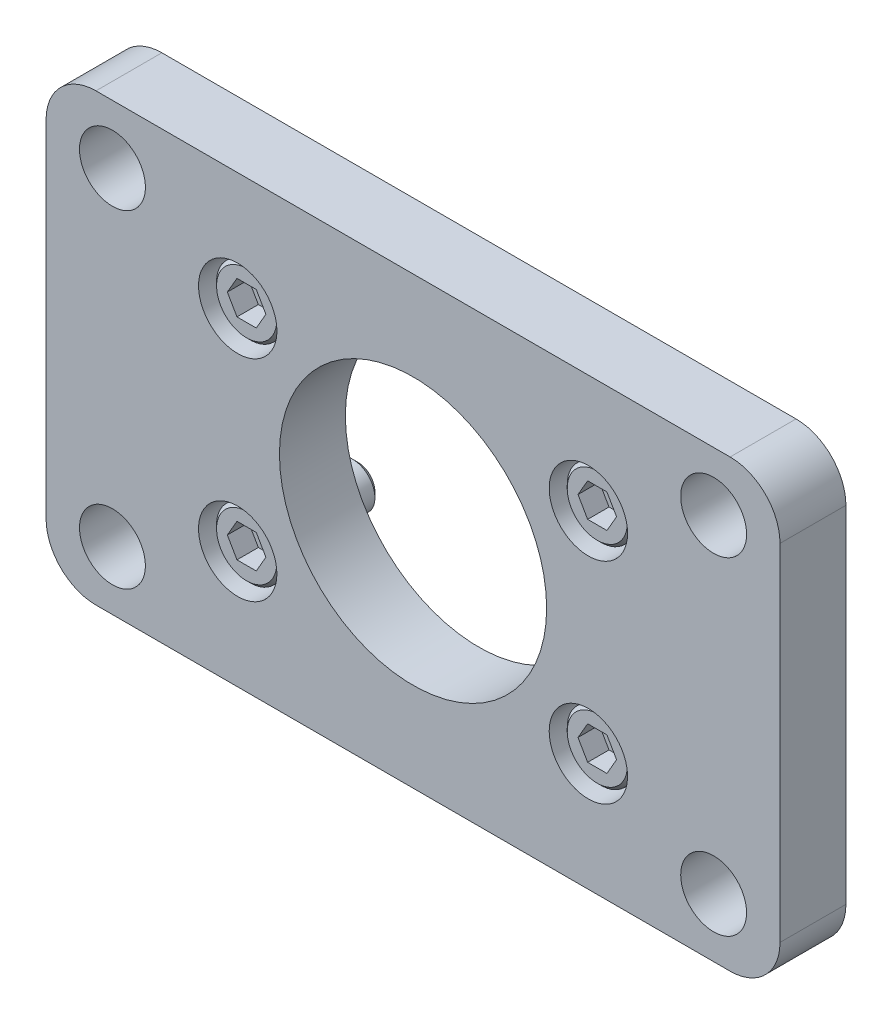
ISO-10303-21;
HEADER;
FILE_DESCRIPTION(('STEP AP214'),'2;1');
FILE_NAME('part.step','',(''),(''),'','','');
FILE_SCHEMA(('AUTOMOTIVE_DESIGN { 1 0 10303 214 1 1 1 1 }'));
ENDSEC;
DATA;
#1=APPLICATION_CONTEXT('core data for automotive mechanical design processes');
#2=APPLICATION_PROTOCOL_DEFINITION('international standard','automotive_design',2000,#1);
#3=PRODUCT_CONTEXT('',#1,'mechanical');
#4=PRODUCT('Part','Part','',(#3));
#5=PRODUCT_RELATED_PRODUCT_CATEGORY('part','',(#4));
#6=PRODUCT_DEFINITION_FORMATION('','',#4);
#7=PRODUCT_DEFINITION_CONTEXT('part definition',#1,'design');
#8=PRODUCT_DEFINITION('design','',#6,#7);
#9=PRODUCT_DEFINITION_SHAPE('','',#8);
#10=(LENGTH_UNIT() NAMED_UNIT(*) SI_UNIT(.MILLI.,.METRE.));
#11=(NAMED_UNIT(*) PLANE_ANGLE_UNIT() SI_UNIT($,.RADIAN.));
#12=(NAMED_UNIT(*) SI_UNIT($,.STERADIAN.) SOLID_ANGLE_UNIT());
#13=UNCERTAINTY_MEASURE_WITH_UNIT(LENGTH_MEASURE(1.E-05),#10,'distance_accuracy_value','');
#14=(GEOMETRIC_REPRESENTATION_CONTEXT(3) GLOBAL_UNCERTAINTY_ASSIGNED_CONTEXT((#13)) GLOBAL_UNIT_ASSIGNED_CONTEXT((#10,
#11,#12)) REPRESENTATION_CONTEXT('',''));
#15=CARTESIAN_POINT('',(0.,0.,0.));
#16=DIRECTION('',(0.,0.,1.));
#17=DIRECTION('',(1.,0.,0.));
#18=AXIS2_PLACEMENT_3D('',#15,#16,#17);
#19=CARTESIAN_POINT('',(29.1244459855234,17.38125,-4.318));
#20=DIRECTION('',(0.,0.,1.));
#21=DIRECTION('',(0.,-1.,0.));
#22=AXIS2_PLACEMENT_3D('',#19,#20,#21);
#23=PLANE('',#22);
#24=DIRECTION('',(0.5,0.866025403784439,0.));
#25=VECTOR('',#24,1.);
#26=CARTESIAN_POINT('',(26.3748153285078,12.61875,-4.318));
#27=LINE('',#26,#25);
#28=CARTESIAN_POINT('',(26.3748153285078,12.61875,-4.318));
#29=VERTEX_POINT('',#28);
#30=CARTESIAN_POINT('',(27.7496306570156,15.,-4.318));
#31=VERTEX_POINT('',#30);
#32=EDGE_CURVE('E1673',#29,#31,#27,.T.);
#33=ORIENTED_EDGE('',*,*,#32,.T.);
#34=DIRECTION('',(-0.5,0.866025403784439,0.));
#35=VECTOR('',#34,1.);
#36=CARTESIAN_POINT('',(27.7496306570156,15.,-4.318));
#37=LINE('',#36,#35);
#38=CARTESIAN_POINT('',(26.3748153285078,17.38125,-4.318));
#39=VERTEX_POINT('',#38);
#40=EDGE_CURVE('E1707',#31,#39,#37,.T.);
#41=ORIENTED_EDGE('',*,*,#40,.T.);
#42=DIRECTION('',(-1.,0.,0.));
#43=VECTOR('',#42,1.);
#44=CARTESIAN_POINT('',(26.3748153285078,17.38125,-4.318));
#45=LINE('',#44,#43);
#46=CARTESIAN_POINT('',(23.6251846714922,17.38125,-4.318));
#47=VERTEX_POINT('',#46);
#48=EDGE_CURVE('E1702',#39,#47,#45,.T.);
#49=ORIENTED_EDGE('',*,*,#48,.T.);
#50=DIRECTION('',(-0.5,-0.866025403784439,0.));
#51=VECTOR('',#50,1.);
#52=CARTESIAN_POINT('',(23.6251846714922,17.38125,-4.318));
#53=LINE('',#52,#51);
#54=CARTESIAN_POINT('',(22.2503693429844,15.,-4.318));
#55=VERTEX_POINT('',#54);
#56=EDGE_CURVE('E1699',#47,#55,#53,.T.);
#57=ORIENTED_EDGE('',*,*,#56,.T.);
#58=DIRECTION('',(0.5,-0.866025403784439,0.));
#59=VECTOR('',#58,1.);
#60=CARTESIAN_POINT('',(22.2503693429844,15.,-4.318));
#61=LINE('',#60,#59);
#62=CARTESIAN_POINT('',(23.6251846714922,12.61875,-4.318));
#63=VERTEX_POINT('',#62);
#64=EDGE_CURVE('E1695',#55,#63,#61,.T.);
#65=ORIENTED_EDGE('',*,*,#64,.T.);
#66=DIRECTION('',(1.,0.,0.));
#67=VECTOR('',#66,1.);
#68=CARTESIAN_POINT('',(23.6251846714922,12.61875,-4.318));
#69=LINE('',#68,#67);
#70=EDGE_CURVE('E1659',#63,#29,#69,.T.);
#71=ORIENTED_EDGE('',*,*,#70,.T.);
#72=EDGE_LOOP('',(#33,#41,#49,#57,#65,#71));
#73=FACE_BOUND('',#72,.T.);
#74=ADVANCED_FACE('F16',(#73),#23,.T.);
#75=CARTESIAN_POINT('',(27.7496306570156,15.,-4.318));
#76=DIRECTION('',(0.866025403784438,0.5,0.));
#77=DIRECTION('',(-0.5,0.866025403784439,0.));
#78=AXIS2_PLACEMENT_3D('',#75,#76,#77);
#79=PLANE('',#78);
#80=DIRECTION('',(-0.5,0.866025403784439,0.));
#81=VECTOR('',#80,1.);
#82=CARTESIAN_POINT('',(27.7496306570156,15.,-1.27));
#83=LINE('',#82,#81);
#84=CARTESIAN_POINT('',(27.7496306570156,15.,-1.27));
#85=VERTEX_POINT('',#84);
#86=CARTESIAN_POINT('',(26.3748153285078,17.38125,-1.27));
#87=VERTEX_POINT('',#86);
#88=EDGE_CURVE('E1653',#85,#87,#83,.T.);
#89=ORIENTED_EDGE('',*,*,#88,.T.);
#90=DIRECTION('',(0.,0.,1.));
#91=VECTOR('',#90,1.);
#92=CARTESIAN_POINT('',(26.3748153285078,17.38125,-4.318));
#93=LINE('',#92,#91);
#94=EDGE_CURVE('E1685',#39,#87,#93,.T.);
#95=ORIENTED_EDGE('',*,*,#94,.F.);
#96=ORIENTED_EDGE('',*,*,#40,.F.);
#97=DIRECTION('',(0.,0.,1.));
#98=VECTOR('',#97,1.);
#99=CARTESIAN_POINT('',(27.7496306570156,15.,-4.318));
#100=LINE('',#99,#98);
#101=EDGE_CURVE('E1688',#31,#85,#100,.T.);
#102=ORIENTED_EDGE('',*,*,#101,.T.);
#103=EDGE_LOOP('',(#89,#95,#96,#102));
#104=FACE_BOUND('',#103,.T.);
#105=ADVANCED_FACE('F1260',(#104),#79,.F.);
#106=CARTESIAN_POINT('',(26.3748153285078,17.38125,-4.318));
#107=DIRECTION('',(0.,1.,0.));
#108=DIRECTION('',(-1.,0.,0.));
#109=AXIS2_PLACEMENT_3D('',#106,#107,#108);
#110=PLANE('',#109);
#111=DIRECTION('',(-1.,0.,0.));
#112=VECTOR('',#111,1.);
#113=CARTESIAN_POINT('',(26.3748153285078,17.38125,-1.27));
#114=LINE('',#113,#112);
#115=CARTESIAN_POINT('',(23.6251846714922,17.38125,-1.27));
#116=VERTEX_POINT('',#115);
#117=EDGE_CURVE('E1656',#87,#116,#114,.T.);
#118=ORIENTED_EDGE('',*,*,#117,.T.);
#119=DIRECTION('',(0.,0.,1.));
#120=VECTOR('',#119,1.);
#121=CARTESIAN_POINT('',(23.6251846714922,17.38125,-4.318));
#122=LINE('',#121,#120);
#123=EDGE_CURVE('E1682',#47,#116,#122,.T.);
#124=ORIENTED_EDGE('',*,*,#123,.F.);
#125=ORIENTED_EDGE('',*,*,#48,.F.);
#126=ORIENTED_EDGE('',*,*,#94,.T.);
#127=EDGE_LOOP('',(#118,#124,#125,#126));
#128=FACE_BOUND('',#127,.T.);
#129=ADVANCED_FACE('F1271',(#128),#110,.F.);
#130=CARTESIAN_POINT('',(23.6251846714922,17.38125,-4.318));
#131=DIRECTION('',(-0.866025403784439,0.5,0.));
#132=DIRECTION('',(-0.5,-0.866025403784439,0.));
#133=AXIS2_PLACEMENT_3D('',#130,#131,#132);
#134=PLANE('',#133);
#135=DIRECTION('',(-0.5,-0.866025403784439,0.));
#136=VECTOR('',#135,1.);
#137=CARTESIAN_POINT('',(23.6251846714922,17.38125,-1.27));
#138=LINE('',#137,#136);
#139=CARTESIAN_POINT('',(22.2503693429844,15.,-1.27));
#140=VERTEX_POINT('',#139);
#141=EDGE_CURVE('E1664',#116,#140,#138,.T.);
#142=ORIENTED_EDGE('',*,*,#141,.T.);
#143=DIRECTION('',(0.,0.,1.));
#144=VECTOR('',#143,1.);
#145=CARTESIAN_POINT('',(22.2503693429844,15.,-4.318));
#146=LINE('',#145,#144);
#147=EDGE_CURVE('E1679',#55,#140,#146,.T.);
#148=ORIENTED_EDGE('',*,*,#147,.F.);
#149=ORIENTED_EDGE('',*,*,#56,.F.);
#150=ORIENTED_EDGE('',*,*,#123,.T.);
#151=EDGE_LOOP('',(#142,#148,#149,#150));
#152=FACE_BOUND('',#151,.T.);
#153=ADVANCED_FACE('F1282',(#152),#134,.F.);
#154=CARTESIAN_POINT('',(22.2503693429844,15.,-4.318));
#155=DIRECTION('',(-0.866025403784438,-0.5,0.));
#156=DIRECTION('',(0.5,-0.866025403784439,0.));
#157=AXIS2_PLACEMENT_3D('',#154,#155,#156);
#158=PLANE('',#157);
#159=DIRECTION('',(0.5,-0.866025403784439,0.));
#160=VECTOR('',#159,1.);
#161=CARTESIAN_POINT('',(22.2503693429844,15.,-1.27));
#162=LINE('',#161,#160);
#163=CARTESIAN_POINT('',(23.6251846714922,12.61875,-1.27));
#164=VERTEX_POINT('',#163);
#165=EDGE_CURVE('E1667',#140,#164,#162,.T.);
#166=ORIENTED_EDGE('',*,*,#165,.T.);
#167=DIRECTION('',(0.,0.,1.));
#168=VECTOR('',#167,1.);
#169=CARTESIAN_POINT('',(23.6251846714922,12.61875,-4.318));
#170=LINE('',#169,#168);
#171=EDGE_CURVE('E1676',#63,#164,#170,.T.);
#172=ORIENTED_EDGE('',*,*,#171,.F.);
#173=ORIENTED_EDGE('',*,*,#64,.F.);
#174=ORIENTED_EDGE('',*,*,#147,.T.);
#175=EDGE_LOOP('',(#166,#172,#173,#174));
#176=FACE_BOUND('',#175,.T.);
#177=ADVANCED_FACE('F1293',(#176),#158,.F.);
#178=CARTESIAN_POINT('',(23.6251846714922,12.61875,-4.318));
#179=DIRECTION('',(0.,-1.,0.));
#180=DIRECTION('',(1.,0.,0.));
#181=AXIS2_PLACEMENT_3D('',#178,#179,#180);
#182=PLANE('',#181);
#183=DIRECTION('',(1.,0.,0.));
#184=VECTOR('',#183,1.);
#185=CARTESIAN_POINT('',(23.6251846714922,12.61875,-1.27));
#186=LINE('',#185,#184);
#187=CARTESIAN_POINT('',(26.3748153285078,12.61875,-1.27));
#188=VERTEX_POINT('',#187);
#189=EDGE_CURVE('E1670',#164,#188,#186,.T.);
#190=ORIENTED_EDGE('',*,*,#189,.T.);
#191=DIRECTION('',(0.,0.,1.));
#192=VECTOR('',#191,1.);
#193=CARTESIAN_POINT('',(26.3748153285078,12.61875,-4.318));
#194=LINE('',#193,#192);
#195=EDGE_CURVE('E1674',#29,#188,#194,.T.);
#196=ORIENTED_EDGE('',*,*,#195,.F.);
#197=ORIENTED_EDGE('',*,*,#70,.F.);
#198=ORIENTED_EDGE('',*,*,#171,.T.);
#199=EDGE_LOOP('',(#190,#196,#197,#198));
#200=FACE_BOUND('',#199,.T.);
#201=ADVANCED_FACE('F1304',(#200),#182,.F.);
#202=CARTESIAN_POINT('',(26.3748153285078,12.61875,-4.318));
#203=DIRECTION('',(0.866025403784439,-0.5,0.));
#204=DIRECTION('',(0.5,0.866025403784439,0.));
#205=AXIS2_PLACEMENT_3D('',#202,#203,#204);
#206=PLANE('',#205);
#207=DIRECTION('',(0.5,0.866025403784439,0.));
#208=VECTOR('',#207,1.);
#209=CARTESIAN_POINT('',(26.3748153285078,12.61875,-1.27));
#210=LINE('',#209,#208);
#211=EDGE_CURVE('E35',#188,#85,#210,.T.);
#212=ORIENTED_EDGE('',*,*,#211,.T.);
#213=ORIENTED_EDGE('',*,*,#101,.F.);
#214=ORIENTED_EDGE('',*,*,#32,.F.);
#215=ORIENTED_EDGE('',*,*,#195,.T.);
#216=EDGE_LOOP('',(#212,#213,#214,#215));
#217=FACE_BOUND('',#216,.T.);
#218=ADVANCED_FACE('F1315',(#217),#206,.F.);
#219=CARTESIAN_POINT('',(29.28625,15.,-1.27));
#220=DIRECTION('',(0.,0.,1.));
#221=DIRECTION('',(0.,-1.,0.));
#222=AXIS2_PLACEMENT_3D('',#219,#220,#221);
#223=PLANE('',#222);
#224=ORIENTED_EDGE('',*,*,#211,.F.);
#225=ORIENTED_EDGE('',*,*,#189,.F.);
#226=ORIENTED_EDGE('',*,*,#165,.F.);
#227=ORIENTED_EDGE('',*,*,#141,.F.);
#228=ORIENTED_EDGE('',*,*,#117,.F.);
#229=ORIENTED_EDGE('',*,*,#88,.F.);
#230=EDGE_LOOP('',(#224,#225,#226,#227,#228,#229));
#231=FACE_BOUND('',#230,.T.);
#232=CARTESIAN_POINT('',(25.,15.,-1.27));
#233=DIRECTION('',(0.,0.,-1.));
#234=DIRECTION('',(0.,1.,0.));
#235=AXIS2_PLACEMENT_3D('',#232,#233,#234);
#236=CIRCLE('',#235,4.28625);
#237=CARTESIAN_POINT('',(25.,19.28625,-1.27));
#238=VERTEX_POINT('',#237);
#239=EDGE_CURVE('E1414',#238,#238,#236,.T.);
#240=ORIENTED_EDGE('',*,*,#239,.F.);
#241=EDGE_LOOP('',(#240));
#242=FACE_BOUND('',#241,.T.);
#243=ADVANCED_FACE('F1326',(#231,#242),#223,.T.);
#244=CARTESIAN_POINT('',(25.,15.,-1.74625));
#245=DIRECTION('',(0.,0.,-1.));
#246=DIRECTION('',(0.,1.,0.));
#247=AXIS2_PLACEMENT_3D('',#244,#245,#246);
#248=CONICAL_SURFACE('',#247,4.7625,0.785398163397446);
#249=ORIENTED_EDGE('',*,*,#239,.T.);
#250=EDGE_LOOP('',(#249));
#251=FACE_BOUND('',#250,.T.);
#252=CARTESIAN_POINT('',(25.,15.,-1.74625));
#253=DIRECTION('',(0.,0.,-1.));
#254=DIRECTION('',(0.,1.,0.));
#255=AXIS2_PLACEMENT_3D('',#252,#253,#254);
#256=CIRCLE('',#255,4.7625);
#257=CARTESIAN_POINT('',(25.,19.7625,-1.74625));
#258=VERTEX_POINT('',#257);
#259=EDGE_CURVE('E1417',#258,#258,#256,.T.);
#260=ORIENTED_EDGE('',*,*,#259,.F.);
#261=EDGE_LOOP('',(#260));
#262=FACE_BOUND('',#261,.T.);
#263=ADVANCED_FACE('F1336',(#251,#262),#248,.T.);
#264=CARTESIAN_POINT('',(25.,15.,-7.62));
#265=DIRECTION('',(0.,0.,-1.));
#266=DIRECTION('',(0.,1.,0.));
#267=AXIS2_PLACEMENT_3D('',#264,#265,#266);
#268=CYLINDRICAL_SURFACE('',#267,4.7625);
#269=ORIENTED_EDGE('',*,*,#259,.T.);
#270=EDGE_LOOP('',(#269));
#271=FACE_BOUND('',#270,.T.);
#272=CARTESIAN_POINT('',(25.,15.,-7.62));
#273=DIRECTION('',(0.,0.,-1.));
#274=DIRECTION('',(0.,1.,0.));
#275=AXIS2_PLACEMENT_3D('',#272,#273,#274);
#276=CIRCLE('',#275,4.7625);
#277=CARTESIAN_POINT('',(25.,19.7625,-7.62));
#278=VERTEX_POINT('',#277);
#279=EDGE_CURVE('E26',#278,#278,#276,.T.);
#280=ORIENTED_EDGE('',*,*,#279,.F.);
#281=EDGE_LOOP('',(#280));
#282=FACE_BOUND('',#281,.T.);
#283=ADVANCED_FACE('F1347',(#271,#282),#268,.T.);
#284=CARTESIAN_POINT('',(25.,15.,-7.62));
#285=DIRECTION('',(0.,0.,-1.));
#286=DIRECTION('',(0.,1.,0.));
#287=AXIS2_PLACEMENT_3D('',#284,#285,#286);
#288=PLANE('',#287);
#289=CARTESIAN_POINT('',(25.,15.,-7.62));
#290=DIRECTION('',(0.,0.,1.));
#291=DIRECTION('',(0.,-1.,0.));
#292=AXIS2_PLACEMENT_3D('',#289,#290,#291);
#293=CIRCLE('',#292,3.175);
#294=CARTESIAN_POINT('',(25.,11.825,-7.62));
#295=VERTEX_POINT('',#294);
#296=EDGE_CURVE('E1419',#295,#295,#293,.T.);
#297=ORIENTED_EDGE('',*,*,#296,.T.);
#298=EDGE_LOOP('',(#297));
#299=FACE_BOUND('',#298,.T.);
#300=CARTESIAN_POINT('',(25.,15.,-7.62));
#301=DIRECTION('',(0.,0.,-1.));
#302=DIRECTION('',(-1.,0.,0.));
#303=AXIS2_PLACEMENT_3D('',#300,#301,#302);
#304=CIRCLE('',#303,3.3782);
#305=CARTESIAN_POINT('',(21.6218,15.,-7.62));
#306=VERTEX_POINT('',#305);
#307=EDGE_CURVE('E10',#306,#306,#304,.T.);
#308=ORIENTED_EDGE('',*,*,#307,.T.);
#309=EDGE_LOOP('',(#308));
#310=FACE_BOUND('',#309,.T.);
#311=ADVANCED_FACE('F1358',(#299,#310),#288,.T.);
#312=CARTESIAN_POINT('',(25.,15.,-17.145));
#313=DIRECTION('',(0.,0.,1.));
#314=DIRECTION('',(0.,-1.,0.));
#315=AXIS2_PLACEMENT_3D('',#312,#313,#314);
#316=PLANE('',#315);
#317=CARTESIAN_POINT('',(25.,15.,-17.145));
#318=DIRECTION('',(0.,0.,1.));
#319=DIRECTION('',(0.,-1.,0.));
#320=AXIS2_PLACEMENT_3D('',#317,#318,#319);
#321=CIRCLE('',#320,2.41935);
#322=CARTESIAN_POINT('',(25.,12.58065,-17.145));
#323=VERTEX_POINT('',#322);
#324=EDGE_CURVE('E1413',#323,#323,#321,.T.);
#325=ORIENTED_EDGE('',*,*,#324,.F.);
#326=EDGE_LOOP('',(#325));
#327=FACE_BOUND('',#326,.T.);
#328=ADVANCED_FACE('F1369',(#327),#316,.F.);
#329=CARTESIAN_POINT('',(25.,15.,-17.145));
#330=DIRECTION('',(0.,0.,1.));
#331=DIRECTION('',(0.,-1.,0.));
#332=AXIS2_PLACEMENT_3D('',#329,#330,#331);
#333=CONICAL_SURFACE('',#332,2.41935,0.785398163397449);
#334=CARTESIAN_POINT('',(25.,15.,-16.38935));
#335=DIRECTION('',(0.,0.,1.));
#336=DIRECTION('',(0.,-1.,0.));
#337=AXIS2_PLACEMENT_3D('',#334,#335,#336);
#338=CIRCLE('',#337,3.175);
#339=CARTESIAN_POINT('',(25.,11.825,-16.38935));
#340=VERTEX_POINT('',#339);
#341=EDGE_CURVE('E1410',#340,#340,#338,.T.);
#342=ORIENTED_EDGE('',*,*,#341,.F.);
#343=EDGE_LOOP('',(#342));
#344=FACE_BOUND('',#343,.T.);
#345=ORIENTED_EDGE('',*,*,#324,.T.);
#346=EDGE_LOOP('',(#345));
#347=FACE_BOUND('',#346,.T.);
#348=ADVANCED_FACE('F473',(#344,#347),#333,.T.);
#349=CARTESIAN_POINT('',(25.,15.,-7.62));
#350=DIRECTION('',(0.,0.,1.));
#351=DIRECTION('',(0.,-1.,0.));
#352=AXIS2_PLACEMENT_3D('',#349,#350,#351);
#353=CYLINDRICAL_SURFACE('',#352,3.175);
#354=ORIENTED_EDGE('',*,*,#296,.F.);
#355=EDGE_LOOP('',(#354));
#356=FACE_BOUND('',#355,.T.);
#357=ORIENTED_EDGE('',*,*,#341,.T.);
#358=EDGE_LOOP('',(#357));
#359=FACE_BOUND('',#358,.T.);
#360=ADVANCED_FACE('F464',(#356,#359),#353,.T.);
#361=CARTESIAN_POINT('',(29.1244459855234,-12.61875,-4.318));
#362=DIRECTION('',(0.,0.,1.));
#363=DIRECTION('',(0.,-1.,0.));
#364=AXIS2_PLACEMENT_3D('',#361,#362,#363);
#365=PLANE('',#364);
#366=DIRECTION('',(0.5,0.866025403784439,0.));
#367=VECTOR('',#366,1.);
#368=CARTESIAN_POINT('',(26.3748153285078,-17.38125,-4.318));
#369=LINE('',#368,#367);
#370=CARTESIAN_POINT('',(26.3748153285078,-17.38125,-4.318));
#371=VERTEX_POINT('',#370);
#372=CARTESIAN_POINT('',(27.7496306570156,-15.,-4.318));
#373=VERTEX_POINT('',#372);
#374=EDGE_CURVE('E206',#371,#373,#369,.T.);
#375=ORIENTED_EDGE('',*,*,#374,.T.);
#376=DIRECTION('',(-0.5,0.866025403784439,0.));
#377=VECTOR('',#376,1.);
#378=CARTESIAN_POINT('',(27.7496306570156,-15.,-4.318));
#379=LINE('',#378,#377);
#380=CARTESIAN_POINT('',(26.3748153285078,-12.61875,-4.318));
#381=VERTEX_POINT('',#380);
#382=EDGE_CURVE('E317',#373,#381,#379,.T.);
#383=ORIENTED_EDGE('',*,*,#382,.T.);
#384=DIRECTION('',(-1.,0.,0.));
#385=VECTOR('',#384,1.);
#386=CARTESIAN_POINT('',(26.3748153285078,-12.61875,-4.318));
#387=LINE('',#386,#385);
#388=CARTESIAN_POINT('',(23.6251846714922,-12.61875,-4.318));
#389=VERTEX_POINT('',#388);
#390=EDGE_CURVE('E320',#381,#389,#387,.T.);
#391=ORIENTED_EDGE('',*,*,#390,.T.);
#392=DIRECTION('',(-0.5,-0.866025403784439,0.));
#393=VECTOR('',#392,1.);
#394=CARTESIAN_POINT('',(23.6251846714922,-12.61875,-4.318));
#395=LINE('',#394,#393);
#396=CARTESIAN_POINT('',(22.2503693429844,-15.,-4.318));
#397=VERTEX_POINT('',#396);
#398=EDGE_CURVE('E323',#389,#397,#395,.T.);
#399=ORIENTED_EDGE('',*,*,#398,.T.);
#400=DIRECTION('',(0.5,-0.866025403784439,0.));
#401=VECTOR('',#400,1.);
#402=CARTESIAN_POINT('',(22.2503693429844,-15.,-4.318));
#403=LINE('',#402,#401);
#404=CARTESIAN_POINT('',(23.6251846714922,-17.38125,-4.318));
#405=VERTEX_POINT('',#404);
#406=EDGE_CURVE('E325',#397,#405,#403,.T.);
#407=ORIENTED_EDGE('',*,*,#406,.T.);
#408=DIRECTION('',(1.,0.,0.));
#409=VECTOR('',#408,1.);
#410=CARTESIAN_POINT('',(23.6251846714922,-17.38125,-4.318));
#411=LINE('',#410,#409);
#412=EDGE_CURVE('E231',#405,#371,#411,.T.);
#413=ORIENTED_EDGE('',*,*,#412,.T.);
#414=EDGE_LOOP('',(#375,#383,#391,#399,#407,#413));
#415=FACE_BOUND('',#414,.T.);
#416=ADVANCED_FACE('F329',(#415),#365,.T.);
#417=CARTESIAN_POINT('',(-20.8755540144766,-12.61875,-4.318));
#418=DIRECTION('',(0.,0.,1.));
#419=DIRECTION('',(0.,-1.,0.));
#420=AXIS2_PLACEMENT_3D('',#417,#418,#419);
#421=PLANE('',#420);
#422=DIRECTION('',(0.5,0.866025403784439,0.));
#423=VECTOR('',#422,1.);
#424=CARTESIAN_POINT('',(-23.6251846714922,-17.38125,-4.318));
#425=LINE('',#424,#423);
#426=CARTESIAN_POINT('',(-23.6251846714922,-17.38125,-4.318));
#427=VERTEX_POINT('',#426);
#428=CARTESIAN_POINT('',(-22.2503693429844,-15.,-4.318));
#429=VERTEX_POINT('',#428);
#430=EDGE_CURVE('E287',#427,#429,#425,.T.);
#431=ORIENTED_EDGE('',*,*,#430,.T.);
#432=DIRECTION('',(-0.5,0.866025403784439,0.));
#433=VECTOR('',#432,1.);
#434=CARTESIAN_POINT('',(-22.2503693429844,-15.,-4.318));
#435=LINE('',#434,#433);
#436=CARTESIAN_POINT('',(-23.6251846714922,-12.61875,-4.318));
#437=VERTEX_POINT('',#436);
#438=EDGE_CURVE('E577',#429,#437,#435,.T.);
#439=ORIENTED_EDGE('',*,*,#438,.T.);
#440=DIRECTION('',(-1.,0.,0.));
#441=VECTOR('',#440,1.);
#442=CARTESIAN_POINT('',(-23.6251846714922,-12.61875,-4.318));
#443=LINE('',#442,#441);
#444=CARTESIAN_POINT('',(-26.3748153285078,-12.61875,-4.318));
#445=VERTEX_POINT('',#444);
#446=EDGE_CURVE('E580',#437,#445,#443,.T.);
#447=ORIENTED_EDGE('',*,*,#446,.T.);
#448=DIRECTION('',(-0.5,-0.866025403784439,0.));
#449=VECTOR('',#448,1.);
#450=CARTESIAN_POINT('',(-26.3748153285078,-12.61875,-4.318));
#451=LINE('',#450,#449);
#452=CARTESIAN_POINT('',(-27.7496306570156,-15.,-4.318));
#453=VERTEX_POINT('',#452);
#454=EDGE_CURVE('E583',#445,#453,#451,.T.);
#455=ORIENTED_EDGE('',*,*,#454,.T.);
#456=DIRECTION('',(0.5,-0.866025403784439,0.));
#457=VECTOR('',#456,1.);
#458=CARTESIAN_POINT('',(-27.7496306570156,-15.,-4.318));
#459=LINE('',#458,#457);
#460=CARTESIAN_POINT('',(-26.3748153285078,-17.38125,-4.318));
#461=VERTEX_POINT('',#460);
#462=EDGE_CURVE('E585',#453,#461,#459,.T.);
#463=ORIENTED_EDGE('',*,*,#462,.T.);
#464=DIRECTION('',(1.,0.,0.));
#465=VECTOR('',#464,1.);
#466=CARTESIAN_POINT('',(-26.3748153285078,-17.38125,-4.318));
#467=LINE('',#466,#465);
#468=EDGE_CURVE('E273',#461,#427,#467,.T.);
#469=ORIENTED_EDGE('',*,*,#468,.T.);
#470=EDGE_LOOP('',(#431,#439,#447,#455,#463,#469));
#471=FACE_BOUND('',#470,.T.);
#472=ADVANCED_FACE('F463',(#471),#421,.T.);
#473=CARTESIAN_POINT('',(-20.8755540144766,17.38125,-4.318));
#474=DIRECTION('',(0.,0.,1.));
#475=DIRECTION('',(0.,-1.,0.));
#476=AXIS2_PLACEMENT_3D('',#473,#474,#475);
#477=PLANE('',#476);
#478=DIRECTION('',(0.5,0.866025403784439,0.));
#479=VECTOR('',#478,1.);
#480=CARTESIAN_POINT('',(-23.6251846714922,12.61875,-4.318));
#481=LINE('',#480,#479);
#482=CARTESIAN_POINT('',(-23.6251846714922,12.61875,-4.318));
#483=VERTEX_POINT('',#482);
#484=CARTESIAN_POINT('',(-22.2503693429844,15.,-4.318));
#485=VERTEX_POINT('',#484);
#486=EDGE_CURVE('E1427',#483,#485,#481,.T.);
#487=ORIENTED_EDGE('',*,*,#486,.T.);
#488=DIRECTION('',(-0.5,0.866025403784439,0.));
#489=VECTOR('',#488,1.);
#490=CARTESIAN_POINT('',(-22.2503693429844,15.,-4.318));
#491=LINE('',#490,#489);
#492=CARTESIAN_POINT('',(-23.6251846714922,17.38125,-4.318));
#493=VERTEX_POINT('',#492);
#494=EDGE_CURVE('E1430',#485,#493,#491,.T.);
#495=ORIENTED_EDGE('',*,*,#494,.T.);
#496=DIRECTION('',(-1.,0.,0.));
#497=VECTOR('',#496,1.);
#498=CARTESIAN_POINT('',(-23.6251846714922,17.38125,-4.318));
#499=LINE('',#498,#497);
#500=CARTESIAN_POINT('',(-26.3748153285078,17.38125,-4.318));
#501=VERTEX_POINT('',#500);
#502=EDGE_CURVE('E1434',#493,#501,#499,.T.);
#503=ORIENTED_EDGE('',*,*,#502,.T.);
#504=DIRECTION('',(-0.5,-0.866025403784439,0.));
#505=VECTOR('',#504,1.);
#506=CARTESIAN_POINT('',(-26.3748153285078,17.38125,-4.318));
#507=LINE('',#506,#505);
#508=CARTESIAN_POINT('',(-27.7496306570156,15.,-4.318));
#509=VERTEX_POINT('',#508);
#510=EDGE_CURVE('E1437',#501,#509,#507,.T.);
#511=ORIENTED_EDGE('',*,*,#510,.T.);
#512=DIRECTION('',(0.5,-0.866025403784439,0.));
#513=VECTOR('',#512,1.);
#514=CARTESIAN_POINT('',(-27.7496306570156,15.,-4.318));
#515=LINE('',#514,#513);
#516=CARTESIAN_POINT('',(-26.3748153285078,12.61875,-4.318));
#517=VERTEX_POINT('',#516);
#518=EDGE_CURVE('E1440',#509,#517,#515,.T.);
#519=ORIENTED_EDGE('',*,*,#518,.T.);
#520=DIRECTION('',(1.,0.,0.));
#521=VECTOR('',#520,1.);
#522=CARTESIAN_POINT('',(-26.3748153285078,12.61875,-4.318));
#523=LINE('',#522,#521);
#524=EDGE_CURVE('E1443',#517,#483,#523,.T.);
#525=ORIENTED_EDGE('',*,*,#524,.T.);
#526=EDGE_LOOP('',(#487,#495,#503,#511,#519,#525));
#527=FACE_BOUND('',#526,.T.);
#528=ADVANCED_FACE('F418',(#527),#477,.T.);
#529=CARTESIAN_POINT('',(27.7496306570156,-15.,-4.318));
#530=DIRECTION('',(0.866025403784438,0.5,0.));
#531=DIRECTION('',(-0.5,0.866025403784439,0.));
#532=AXIS2_PLACEMENT_3D('',#529,#530,#531);
#533=PLANE('',#532);
#534=DIRECTION('',(-0.5,0.866025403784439,0.));
#535=VECTOR('',#534,1.);
#536=CARTESIAN_POINT('',(27.7496306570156,-15.,-1.27));
#537=LINE('',#536,#535);
#538=CARTESIAN_POINT('',(27.7496306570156,-15.,-1.27));
#539=VERTEX_POINT('',#538);
#540=CARTESIAN_POINT('',(26.3748153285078,-12.61875,-1.27));
#541=VERTEX_POINT('',#540);
#542=EDGE_CURVE('E226',#539,#541,#537,.T.);
#543=ORIENTED_EDGE('',*,*,#542,.T.);
#544=DIRECTION('',(0.,0.,1.));
#545=VECTOR('',#544,1.);
#546=CARTESIAN_POINT('',(26.3748153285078,-12.61875,-4.318));
#547=LINE('',#546,#545);
#548=EDGE_CURVE('E245',#381,#541,#547,.T.);
#549=ORIENTED_EDGE('',*,*,#548,.F.);
#550=ORIENTED_EDGE('',*,*,#382,.F.);
#551=DIRECTION('',(0.,0.,1.));
#552=VECTOR('',#551,1.);
#553=CARTESIAN_POINT('',(27.7496306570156,-15.,-4.318));
#554=LINE('',#553,#552);
#555=EDGE_CURVE('E247',#373,#539,#554,.T.);
#556=ORIENTED_EDGE('',*,*,#555,.T.);
#557=EDGE_LOOP('',(#543,#549,#550,#556));
#558=FACE_BOUND('',#557,.T.);
#559=ADVANCED_FACE('F333',(#558),#533,.F.);
#560=CARTESIAN_POINT('',(26.3748153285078,-12.61875,-4.318));
#561=DIRECTION('',(0.,1.,0.));
#562=DIRECTION('',(-1.,0.,0.));
#563=AXIS2_PLACEMENT_3D('',#560,#561,#562);
#564=PLANE('',#563);
#565=DIRECTION('',(-1.,0.,0.));
#566=VECTOR('',#565,1.);
#567=CARTESIAN_POINT('',(26.3748153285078,-12.61875,-1.27));
#568=LINE('',#567,#566);
#569=CARTESIAN_POINT('',(23.6251846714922,-12.61875,-1.27));
#570=VERTEX_POINT('',#569);
#571=EDGE_CURVE('E228',#541,#570,#568,.T.);
#572=ORIENTED_EDGE('',*,*,#571,.T.);
#573=DIRECTION('',(0.,0.,1.));
#574=VECTOR('',#573,1.);
#575=CARTESIAN_POINT('',(23.6251846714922,-12.61875,-4.318));
#576=LINE('',#575,#574);
#577=EDGE_CURVE('E243',#389,#570,#576,.T.);
#578=ORIENTED_EDGE('',*,*,#577,.F.);
#579=ORIENTED_EDGE('',*,*,#390,.F.);
#580=ORIENTED_EDGE('',*,*,#548,.T.);
#581=EDGE_LOOP('',(#572,#578,#579,#580));
#582=FACE_BOUND('',#581,.T.);
#583=ADVANCED_FACE('F335',(#582),#564,.F.);
#584=CARTESIAN_POINT('',(23.6251846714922,-12.61875,-4.318));
#585=DIRECTION('',(-0.866025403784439,0.5,0.));
#586=DIRECTION('',(-0.5,-0.866025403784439,0.));
#587=AXIS2_PLACEMENT_3D('',#584,#585,#586);
#588=PLANE('',#587);
#589=DIRECTION('',(-0.5,-0.866025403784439,0.));
#590=VECTOR('',#589,1.);
#591=CARTESIAN_POINT('',(23.6251846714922,-12.61875,-1.27));
#592=LINE('',#591,#590);
#593=CARTESIAN_POINT('',(22.2503693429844,-15.,-1.27));
#594=VERTEX_POINT('',#593);
#595=EDGE_CURVE('E236',#570,#594,#592,.T.);
#596=ORIENTED_EDGE('',*,*,#595,.T.);
#597=DIRECTION('',(0.,0.,1.));
#598=VECTOR('',#597,1.);
#599=CARTESIAN_POINT('',(22.2503693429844,-15.,-4.318));
#600=LINE('',#599,#598);
#601=EDGE_CURVE('E241',#397,#594,#600,.T.);
#602=ORIENTED_EDGE('',*,*,#601,.F.);
#603=ORIENTED_EDGE('',*,*,#398,.F.);
#604=ORIENTED_EDGE('',*,*,#577,.T.);
#605=EDGE_LOOP('',(#596,#602,#603,#604));
#606=FACE_BOUND('',#605,.T.);
#607=ADVANCED_FACE('F339',(#606),#588,.F.);
#608=CARTESIAN_POINT('',(22.2503693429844,-15.,-4.318));
#609=DIRECTION('',(-0.866025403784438,-0.5,0.));
#610=DIRECTION('',(0.5,-0.866025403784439,0.));
#611=AXIS2_PLACEMENT_3D('',#608,#609,#610);
#612=PLANE('',#611);
#613=DIRECTION('',(0.5,-0.866025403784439,0.));
#614=VECTOR('',#613,1.);
#615=CARTESIAN_POINT('',(22.2503693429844,-15.,-1.27));
#616=LINE('',#615,#614);
#617=CARTESIAN_POINT('',(23.6251846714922,-17.38125,-1.27));
#618=VERTEX_POINT('',#617);
#619=EDGE_CURVE('E219',#594,#618,#616,.T.);
#620=ORIENTED_EDGE('',*,*,#619,.T.);
#621=DIRECTION('',(0.,0.,1.));
#622=VECTOR('',#621,1.);
#623=CARTESIAN_POINT('',(23.6251846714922,-17.38125,-4.318));
#624=LINE('',#623,#622);
#625=EDGE_CURVE('E211',#405,#618,#624,.T.);
#626=ORIENTED_EDGE('',*,*,#625,.F.);
#627=ORIENTED_EDGE('',*,*,#406,.F.);
#628=ORIENTED_EDGE('',*,*,#601,.T.);
#629=EDGE_LOOP('',(#620,#626,#627,#628));
#630=FACE_BOUND('',#629,.T.);
#631=ADVANCED_FACE('F341',(#630),#612,.F.);
#632=CARTESIAN_POINT('',(23.6251846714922,-17.38125,-4.318));
#633=DIRECTION('',(0.,-1.,0.));
#634=DIRECTION('',(1.,0.,0.));
#635=AXIS2_PLACEMENT_3D('',#632,#633,#634);
#636=PLANE('',#635);
#637=DIRECTION('',(1.,0.,0.));
#638=VECTOR('',#637,1.);
#639=CARTESIAN_POINT('',(23.6251846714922,-17.38125,-1.27));
#640=LINE('',#639,#638);
#641=CARTESIAN_POINT('',(26.3748153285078,-17.38125,-1.27));
#642=VERTEX_POINT('',#641);
#643=EDGE_CURVE('E214',#618,#642,#640,.T.);
#644=ORIENTED_EDGE('',*,*,#643,.T.);
#645=DIRECTION('',(0.,0.,1.));
#646=VECTOR('',#645,1.);
#647=CARTESIAN_POINT('',(26.3748153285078,-17.38125,-4.318));
#648=LINE('',#647,#646);
#649=EDGE_CURVE('E199',#371,#642,#648,.T.);
#650=ORIENTED_EDGE('',*,*,#649,.F.);
#651=ORIENTED_EDGE('',*,*,#412,.F.);
#652=ORIENTED_EDGE('',*,*,#625,.T.);
#653=EDGE_LOOP('',(#644,#650,#651,#652));
#654=FACE_BOUND('',#653,.T.);
#655=ADVANCED_FACE('F215',(#654),#636,.F.);
#656=CARTESIAN_POINT('',(26.3748153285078,-17.38125,-4.318));
#657=DIRECTION('',(0.866025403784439,-0.5,0.));
#658=DIRECTION('',(0.5,0.866025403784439,0.));
#659=AXIS2_PLACEMENT_3D('',#656,#657,#658);
#660=PLANE('',#659);
#661=DIRECTION('',(0.5,0.866025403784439,0.));
#662=VECTOR('',#661,1.);
#663=CARTESIAN_POINT('',(26.3748153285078,-17.38125,-1.27));
#664=LINE('',#663,#662);
#665=EDGE_CURVE('E203',#642,#539,#664,.T.);
#666=ORIENTED_EDGE('',*,*,#665,.T.);
#667=ORIENTED_EDGE('',*,*,#555,.F.);
#668=ORIENTED_EDGE('',*,*,#374,.F.);
#669=ORIENTED_EDGE('',*,*,#649,.T.);
#670=EDGE_LOOP('',(#666,#667,#668,#669));
#671=FACE_BOUND('',#670,.T.);
#672=ADVANCED_FACE('F201',(#671),#660,.F.);
#673=CARTESIAN_POINT('',(-22.2503693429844,-15.,-4.318));
#674=DIRECTION('',(0.866025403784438,0.5,0.));
#675=DIRECTION('',(-0.5,0.866025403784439,0.));
#676=AXIS2_PLACEMENT_3D('',#673,#674,#675);
#677=PLANE('',#676);
#678=DIRECTION('',(-0.5,0.866025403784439,0.));
#679=VECTOR('',#678,1.);
#680=CARTESIAN_POINT('',(-22.2503693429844,-15.,-1.27));
#681=LINE('',#680,#679);
#682=CARTESIAN_POINT('',(-22.2503693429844,-15.,-1.27));
#683=VERTEX_POINT('',#682);
#684=CARTESIAN_POINT('',(-23.6251846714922,-12.61875,-1.27));
#685=VERTEX_POINT('',#684);
#686=EDGE_CURVE('E264',#683,#685,#681,.T.);
#687=ORIENTED_EDGE('',*,*,#686,.T.);
#688=DIRECTION('',(0.,0.,1.));
#689=VECTOR('',#688,1.);
#690=CARTESIAN_POINT('',(-23.6251846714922,-12.61875,-4.318));
#691=LINE('',#690,#689);
#692=EDGE_CURVE('E297',#437,#685,#691,.T.);
#693=ORIENTED_EDGE('',*,*,#692,.F.);
#694=ORIENTED_EDGE('',*,*,#438,.F.);
#695=DIRECTION('',(0.,0.,1.));
#696=VECTOR('',#695,1.);
#697=CARTESIAN_POINT('',(-22.2503693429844,-15.,-4.318));
#698=LINE('',#697,#696);
#699=EDGE_CURVE('E299',#429,#683,#698,.T.);
#700=ORIENTED_EDGE('',*,*,#699,.T.);
#701=EDGE_LOOP('',(#687,#693,#694,#700));
#702=FACE_BOUND('',#701,.T.);
#703=ADVANCED_FACE('F424',(#702),#677,.F.);
#704=CARTESIAN_POINT('',(-23.6251846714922,-12.61875,-4.318));
#705=DIRECTION('',(0.,1.,0.));
#706=DIRECTION('',(-1.,0.,0.));
#707=AXIS2_PLACEMENT_3D('',#704,#705,#706);
#708=PLANE('',#707);
#709=DIRECTION('',(-1.,0.,0.));
#710=VECTOR('',#709,1.);
#711=CARTESIAN_POINT('',(-23.6251846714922,-12.61875,-1.27));
#712=LINE('',#711,#710);
#713=CARTESIAN_POINT('',(-26.3748153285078,-12.61875,-1.27));
#714=VERTEX_POINT('',#713);
#715=EDGE_CURVE('E270',#685,#714,#712,.T.);
#716=ORIENTED_EDGE('',*,*,#715,.T.);
#717=DIRECTION('',(0.,0.,1.));
#718=VECTOR('',#717,1.);
#719=CARTESIAN_POINT('',(-26.3748153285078,-12.61875,-4.318));
#720=LINE('',#719,#718);
#721=EDGE_CURVE('E295',#445,#714,#720,.T.);
#722=ORIENTED_EDGE('',*,*,#721,.F.);
#723=ORIENTED_EDGE('',*,*,#446,.F.);
#724=ORIENTED_EDGE('',*,*,#692,.T.);
#725=EDGE_LOOP('',(#716,#722,#723,#724));
#726=FACE_BOUND('',#725,.T.);
#727=ADVANCED_FACE('F598',(#726),#708,.F.);
#728=CARTESIAN_POINT('',(-26.3748153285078,-12.61875,-4.318));
#729=DIRECTION('',(-0.866025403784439,0.5,0.));
#730=DIRECTION('',(-0.5,-0.866025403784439,0.));
#731=AXIS2_PLACEMENT_3D('',#728,#729,#730);
#732=PLANE('',#731);
#733=DIRECTION('',(-0.5,-0.866025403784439,0.));
#734=VECTOR('',#733,1.);
#735=CARTESIAN_POINT('',(-26.3748153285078,-12.61875,-1.27));
#736=LINE('',#735,#734);
#737=CARTESIAN_POINT('',(-27.7496306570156,-15.,-1.27));
#738=VERTEX_POINT('',#737);
#739=EDGE_CURVE('E278',#714,#738,#736,.T.);
#740=ORIENTED_EDGE('',*,*,#739,.T.);
#741=DIRECTION('',(0.,0.,1.));
#742=VECTOR('',#741,1.);
#743=CARTESIAN_POINT('',(-27.7496306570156,-15.,-4.318));
#744=LINE('',#743,#742);
#745=EDGE_CURVE('E293',#453,#738,#744,.T.);
#746=ORIENTED_EDGE('',*,*,#745,.F.);
#747=ORIENTED_EDGE('',*,*,#454,.F.);
#748=ORIENTED_EDGE('',*,*,#721,.T.);
#749=EDGE_LOOP('',(#740,#746,#747,#748));
#750=FACE_BOUND('',#749,.T.);
#751=ADVANCED_FACE('F602',(#750),#732,.F.);
#752=CARTESIAN_POINT('',(-27.7496306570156,-15.,-4.318));
#753=DIRECTION('',(-0.866025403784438,-0.5,0.));
#754=DIRECTION('',(0.5,-0.866025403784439,0.));
#755=AXIS2_PLACEMENT_3D('',#752,#753,#754);
#756=PLANE('',#755);
#757=DIRECTION('',(0.5,-0.866025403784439,0.));
#758=VECTOR('',#757,1.);
#759=CARTESIAN_POINT('',(-27.7496306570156,-15.,-1.27));
#760=LINE('',#759,#758);
#761=CARTESIAN_POINT('',(-26.3748153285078,-17.38125,-1.27));
#762=VERTEX_POINT('',#761);
#763=EDGE_CURVE('E281',#738,#762,#760,.T.);
#764=ORIENTED_EDGE('',*,*,#763,.T.);
#765=DIRECTION('',(0.,0.,1.));
#766=VECTOR('',#765,1.);
#767=CARTESIAN_POINT('',(-26.3748153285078,-17.38125,-4.318));
#768=LINE('',#767,#766);
#769=EDGE_CURVE('E291',#461,#762,#768,.T.);
#770=ORIENTED_EDGE('',*,*,#769,.F.);
#771=ORIENTED_EDGE('',*,*,#462,.F.);
#772=ORIENTED_EDGE('',*,*,#745,.T.);
#773=EDGE_LOOP('',(#764,#770,#771,#772));
#774=FACE_BOUND('',#773,.T.);
#775=ADVANCED_FACE('F419',(#774),#756,.F.);
#776=CARTESIAN_POINT('',(-26.3748153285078,-17.38125,-4.318));
#777=DIRECTION('',(0.,-1.,0.));
#778=DIRECTION('',(1.,0.,0.));
#779=AXIS2_PLACEMENT_3D('',#776,#777,#778);
#780=PLANE('',#779);
#781=DIRECTION('',(1.,0.,0.));
#782=VECTOR('',#781,1.);
#783=CARTESIAN_POINT('',(-26.3748153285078,-17.38125,-1.27));
#784=LINE('',#783,#782);
#785=CARTESIAN_POINT('',(-23.6251846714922,-17.38125,-1.27));
#786=VERTEX_POINT('',#785);
#787=EDGE_CURVE('E284',#762,#786,#784,.T.);
#788=ORIENTED_EDGE('',*,*,#787,.T.);
#789=DIRECTION('',(0.,0.,1.));
#790=VECTOR('',#789,1.);
#791=CARTESIAN_POINT('',(-23.6251846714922,-17.38125,-4.318));
#792=LINE('',#791,#790);
#793=EDGE_CURVE('E288',#427,#786,#792,.T.);
#794=ORIENTED_EDGE('',*,*,#793,.F.);
#795=ORIENTED_EDGE('',*,*,#468,.F.);
#796=ORIENTED_EDGE('',*,*,#769,.T.);
#797=EDGE_LOOP('',(#788,#794,#795,#796));
#798=FACE_BOUND('',#797,.T.);
#799=ADVANCED_FACE('F408',(#798),#780,.F.);
#800=CARTESIAN_POINT('',(-23.6251846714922,-17.38125,-4.318));
#801=DIRECTION('',(0.866025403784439,-0.5,0.));
#802=DIRECTION('',(0.5,0.866025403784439,0.));
#803=AXIS2_PLACEMENT_3D('',#800,#801,#802);
#804=PLANE('',#803);
#805=DIRECTION('',(0.5,0.866025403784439,0.));
#806=VECTOR('',#805,1.);
#807=CARTESIAN_POINT('',(-23.6251846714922,-17.38125,-1.27));
#808=LINE('',#807,#806);
#809=EDGE_CURVE('E261',#786,#683,#808,.T.);
#810=ORIENTED_EDGE('',*,*,#809,.T.);
#811=ORIENTED_EDGE('',*,*,#699,.F.);
#812=ORIENTED_EDGE('',*,*,#430,.F.);
#813=ORIENTED_EDGE('',*,*,#793,.T.);
#814=EDGE_LOOP('',(#810,#811,#812,#813));
#815=FACE_BOUND('',#814,.T.);
#816=ADVANCED_FACE('F393',(#815),#804,.F.);
#817=CARTESIAN_POINT('',(-22.2503693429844,15.,-4.318));
#818=DIRECTION('',(0.866025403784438,0.5,0.));
#819=DIRECTION('',(-0.5,0.866025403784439,0.));
#820=AXIS2_PLACEMENT_3D('',#817,#818,#819);
#821=PLANE('',#820);
#822=DIRECTION('',(-0.5,0.866025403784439,0.));
#823=VECTOR('',#822,1.);
#824=CARTESIAN_POINT('',(-22.2503693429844,15.,-1.27));
#825=LINE('',#824,#823);
#826=CARTESIAN_POINT('',(-22.2503693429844,15.,-1.27));
#827=VERTEX_POINT('',#826);
#828=CARTESIAN_POINT('',(-23.6251846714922,17.38125,-1.27));
#829=VERTEX_POINT('',#828);
#830=EDGE_CURVE('E1448',#827,#829,#825,.T.);
#831=ORIENTED_EDGE('',*,*,#830,.T.);
#832=DIRECTION('',(0.,0.,1.));
#833=VECTOR('',#832,1.);
#834=CARTESIAN_POINT('',(-23.6251846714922,17.38125,-4.318));
#835=LINE('',#834,#833);
#836=EDGE_CURVE('E1471',#493,#829,#835,.T.);
#837=ORIENTED_EDGE('',*,*,#836,.F.);
#838=ORIENTED_EDGE('',*,*,#494,.F.);
#839=DIRECTION('',(0.,0.,1.));
#840=VECTOR('',#839,1.);
#841=CARTESIAN_POINT('',(-22.2503693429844,15.,-4.318));
#842=LINE('',#841,#840);
#843=EDGE_CURVE('E1446',#485,#827,#842,.T.);
#844=ORIENTED_EDGE('',*,*,#843,.T.);
#845=EDGE_LOOP('',(#831,#837,#838,#844));
#846=FACE_BOUND('',#845,.T.);
#847=ADVANCED_FACE('F407',(#846),#821,.F.);
#848=CARTESIAN_POINT('',(-23.6251846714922,17.38125,-4.318));
#849=DIRECTION('',(0.,1.,0.));
#850=DIRECTION('',(-1.,0.,0.));
#851=AXIS2_PLACEMENT_3D('',#848,#849,#850);
#852=PLANE('',#851);
#853=DIRECTION('',(-1.,0.,0.));
#854=VECTOR('',#853,1.);
#855=CARTESIAN_POINT('',(-23.6251846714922,17.38125,-1.27));
#856=LINE('',#855,#854);
#857=CARTESIAN_POINT('',(-26.3748153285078,17.38125,-1.27));
#858=VERTEX_POINT('',#857);
#859=EDGE_CURVE('E1451',#829,#858,#856,.T.);
#860=ORIENTED_EDGE('',*,*,#859,.T.);
#861=DIRECTION('',(0.,0.,1.));
#862=VECTOR('',#861,1.);
#863=CARTESIAN_POINT('',(-26.3748153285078,17.38125,-4.318));
#864=LINE('',#863,#862);
#865=EDGE_CURVE('E1469',#501,#858,#864,.T.);
#866=ORIENTED_EDGE('',*,*,#865,.F.);
#867=ORIENTED_EDGE('',*,*,#502,.F.);
#868=ORIENTED_EDGE('',*,*,#836,.T.);
#869=EDGE_LOOP('',(#860,#866,#867,#868));
#870=FACE_BOUND('',#869,.T.);
#871=ADVANCED_FACE('F415',(#870),#852,.F.);
#872=CARTESIAN_POINT('',(-26.3748153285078,17.38125,-4.318));
#873=DIRECTION('',(-0.866025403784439,0.5,0.));
#874=DIRECTION('',(-0.5,-0.866025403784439,0.));
#875=AXIS2_PLACEMENT_3D('',#872,#873,#874);
#876=PLANE('',#875);
#877=DIRECTION('',(-0.5,-0.866025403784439,0.));
#878=VECTOR('',#877,1.);
#879=CARTESIAN_POINT('',(-26.3748153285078,17.38125,-1.27));
#880=LINE('',#879,#878);
#881=CARTESIAN_POINT('',(-27.7496306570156,15.,-1.27));
#882=VERTEX_POINT('',#881);
#883=EDGE_CURVE('E1454',#858,#882,#880,.T.);
#884=ORIENTED_EDGE('',*,*,#883,.T.);
#885=DIRECTION('',(0.,0.,1.));
#886=VECTOR('',#885,1.);
#887=CARTESIAN_POINT('',(-27.7496306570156,15.,-4.318));
#888=LINE('',#887,#886);
#889=EDGE_CURVE('E1467',#509,#882,#888,.T.);
#890=ORIENTED_EDGE('',*,*,#889,.F.);
#891=ORIENTED_EDGE('',*,*,#510,.F.);
#892=ORIENTED_EDGE('',*,*,#865,.T.);
#893=EDGE_LOOP('',(#884,#890,#891,#892));
#894=FACE_BOUND('',#893,.T.);
#895=ADVANCED_FACE('F864',(#894),#876,.F.);
#896=CARTESIAN_POINT('',(-27.7496306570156,15.,-4.318));
#897=DIRECTION('',(-0.866025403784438,-0.5,0.));
#898=DIRECTION('',(0.5,-0.866025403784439,0.));
#899=AXIS2_PLACEMENT_3D('',#896,#897,#898);
#900=PLANE('',#899);
#901=DIRECTION('',(0.5,-0.866025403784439,0.));
#902=VECTOR('',#901,1.);
#903=CARTESIAN_POINT('',(-27.7496306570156,15.,-1.27));
#904=LINE('',#903,#902);
#905=CARTESIAN_POINT('',(-26.3748153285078,12.61875,-1.27));
#906=VERTEX_POINT('',#905);
#907=EDGE_CURVE('E1457',#882,#906,#904,.T.);
#908=ORIENTED_EDGE('',*,*,#907,.T.);
#909=DIRECTION('',(0.,0.,1.));
#910=VECTOR('',#909,1.);
#911=CARTESIAN_POINT('',(-26.3748153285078,12.61875,-4.318));
#912=LINE('',#911,#910);
#913=EDGE_CURVE('E1465',#517,#906,#912,.T.);
#914=ORIENTED_EDGE('',*,*,#913,.F.);
#915=ORIENTED_EDGE('',*,*,#518,.F.);
#916=ORIENTED_EDGE('',*,*,#889,.T.);
#917=EDGE_LOOP('',(#908,#914,#915,#916));
#918=FACE_BOUND('',#917,.T.);
#919=ADVANCED_FACE('F873',(#918),#900,.F.);
#920=CARTESIAN_POINT('',(-26.3748153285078,12.61875,-4.318));
#921=DIRECTION('',(0.,-1.,0.));
#922=DIRECTION('',(1.,0.,0.));
#923=AXIS2_PLACEMENT_3D('',#920,#921,#922);
#924=PLANE('',#923);
#925=DIRECTION('',(1.,0.,0.));
#926=VECTOR('',#925,1.);
#927=CARTESIAN_POINT('',(-26.3748153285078,12.61875,-1.27));
#928=LINE('',#927,#926);
#929=CARTESIAN_POINT('',(-23.6251846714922,12.61875,-1.27));
#930=VERTEX_POINT('',#929);
#931=EDGE_CURVE('E1431',#906,#930,#928,.T.);
#932=ORIENTED_EDGE('',*,*,#931,.T.);
#933=DIRECTION('',(0.,0.,1.));
#934=VECTOR('',#933,1.);
#935=CARTESIAN_POINT('',(-23.6251846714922,12.61875,-4.318));
#936=LINE('',#935,#934);
#937=EDGE_CURVE('E1462',#483,#930,#936,.T.);
#938=ORIENTED_EDGE('',*,*,#937,.F.);
#939=ORIENTED_EDGE('',*,*,#524,.F.);
#940=ORIENTED_EDGE('',*,*,#913,.T.);
#941=EDGE_LOOP('',(#932,#938,#939,#940));
#942=FACE_BOUND('',#941,.T.);
#943=ADVANCED_FACE('F882',(#942),#924,.F.);
#944=CARTESIAN_POINT('',(-23.6251846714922,12.61875,-4.318));
#945=DIRECTION('',(0.866025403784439,-0.5,0.));
#946=DIRECTION('',(0.5,0.866025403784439,0.));
#947=AXIS2_PLACEMENT_3D('',#944,#945,#946);
#948=PLANE('',#947);
#949=DIRECTION('',(0.5,0.866025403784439,0.));
#950=VECTOR('',#949,1.);
#951=CARTESIAN_POINT('',(-23.6251846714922,12.61875,-1.27));
#952=LINE('',#951,#950);
#953=EDGE_CURVE('E574',#930,#827,#952,.T.);
#954=ORIENTED_EDGE('',*,*,#953,.T.);
#955=ORIENTED_EDGE('',*,*,#843,.F.);
#956=ORIENTED_EDGE('',*,*,#486,.F.);
#957=ORIENTED_EDGE('',*,*,#937,.T.);
#958=EDGE_LOOP('',(#954,#955,#956,#957));
#959=FACE_BOUND('',#958,.T.);
#960=ADVANCED_FACE('F402',(#959),#948,.F.);
#961=CARTESIAN_POINT('',(29.28625,-15.,-1.27));
#962=DIRECTION('',(0.,0.,1.));
#963=DIRECTION('',(0.,-1.,0.));
#964=AXIS2_PLACEMENT_3D('',#961,#962,#963);
#965=PLANE('',#964);
#966=ORIENTED_EDGE('',*,*,#665,.F.);
#967=ORIENTED_EDGE('',*,*,#643,.F.);
#968=ORIENTED_EDGE('',*,*,#619,.F.);
#969=ORIENTED_EDGE('',*,*,#595,.F.);
#970=ORIENTED_EDGE('',*,*,#571,.F.);
#971=ORIENTED_EDGE('',*,*,#542,.F.);
#972=EDGE_LOOP('',(#966,#967,#968,#969,#970,#971));
#973=FACE_BOUND('',#972,.T.);
#974=CARTESIAN_POINT('',(25.,-15.,-1.27));
#975=DIRECTION('',(0.,0.,-1.));
#976=DIRECTION('',(0.,1.,0.));
#977=AXIS2_PLACEMENT_3D('',#974,#975,#976);
#978=CIRCLE('',#977,4.28625);
#979=CARTESIAN_POINT('',(25.,-10.71375,-1.27));
#980=VERTEX_POINT('',#979);
#981=EDGE_CURVE('E256',#980,#980,#978,.T.);
#982=ORIENTED_EDGE('',*,*,#981,.F.);
#983=EDGE_LOOP('',(#982));
#984=FACE_BOUND('',#983,.T.);
#985=ADVANCED_FACE('F222',(#973,#984),#965,.T.);
#986=CARTESIAN_POINT('',(-20.71375,-15.,-1.27));
#987=DIRECTION('',(0.,0.,1.));
#988=DIRECTION('',(0.,-1.,0.));
#989=AXIS2_PLACEMENT_3D('',#986,#987,#988);
#990=PLANE('',#989);
#991=ORIENTED_EDGE('',*,*,#809,.F.);
#992=ORIENTED_EDGE('',*,*,#787,.F.);
#993=ORIENTED_EDGE('',*,*,#763,.F.);
#994=ORIENTED_EDGE('',*,*,#739,.F.);
#995=ORIENTED_EDGE('',*,*,#715,.F.);
#996=ORIENTED_EDGE('',*,*,#686,.F.);
#997=EDGE_LOOP('',(#991,#992,#993,#994,#995,#996));
#998=FACE_BOUND('',#997,.T.);
#999=CARTESIAN_POINT('',(-25.,-15.,-1.27));
#1000=DIRECTION('',(0.,0.,-1.));
#1001=DIRECTION('',(0.,1.,0.));
#1002=AXIS2_PLACEMENT_3D('',#999,#1000,#1001);
#1003=CIRCLE('',#1002,4.28625);
#1004=CARTESIAN_POINT('',(-25.,-10.71375,-1.27));
#1005=VERTEX_POINT('',#1004);
#1006=EDGE_CURVE('E309',#1005,#1005,#1003,.T.);
#1007=ORIENTED_EDGE('',*,*,#1006,.F.);
#1008=EDGE_LOOP('',(#1007));
#1009=FACE_BOUND('',#1008,.T.);
#1010=ADVANCED_FACE('F377',(#998,#1009),#990,.T.);
#1011=CARTESIAN_POINT('',(-20.71375,15.,-1.27));
#1012=DIRECTION('',(0.,0.,1.));
#1013=DIRECTION('',(0.,-1.,0.));
#1014=AXIS2_PLACEMENT_3D('',#1011,#1012,#1013);
#1015=PLANE('',#1014);
#1016=ORIENTED_EDGE('',*,*,#953,.F.);
#1017=ORIENTED_EDGE('',*,*,#931,.F.);
#1018=ORIENTED_EDGE('',*,*,#907,.F.);
#1019=ORIENTED_EDGE('',*,*,#883,.F.);
#1020=ORIENTED_EDGE('',*,*,#859,.F.);
#1021=ORIENTED_EDGE('',*,*,#830,.F.);
#1022=EDGE_LOOP('',(#1016,#1017,#1018,#1019,#1020,#1021));
#1023=FACE_BOUND('',#1022,.T.);
#1024=CARTESIAN_POINT('',(-25.,15.,-1.27));
#1025=DIRECTION('',(0.,0.,-1.));
#1026=DIRECTION('',(0.,1.,0.));
#1027=AXIS2_PLACEMENT_3D('',#1024,#1025,#1026);
#1028=CIRCLE('',#1027,4.28625);
#1029=CARTESIAN_POINT('',(-25.,19.28625,-1.27));
#1030=VERTEX_POINT('',#1029);
#1031=EDGE_CURVE('E1483',#1030,#1030,#1028,.T.);
#1032=ORIENTED_EDGE('',*,*,#1031,.F.);
#1033=EDGE_LOOP('',(#1032));
#1034=FACE_BOUND('',#1033,.T.);
#1035=ADVANCED_FACE('F386',(#1023,#1034),#1015,.T.);
#1036=CARTESIAN_POINT('',(25.,-15.,-17.145));
#1037=DIRECTION('',(0.,0.,1.));
#1038=DIRECTION('',(0.,-1.,0.));
#1039=AXIS2_PLACEMENT_3D('',#1036,#1037,#1038);
#1040=PLANE('',#1039);
#1041=CARTESIAN_POINT('',(25.,-15.,-17.145));
#1042=DIRECTION('',(0.,0.,1.));
#1043=DIRECTION('',(0.,-1.,0.));
#1044=AXIS2_PLACEMENT_3D('',#1041,#1042,#1043);
#1045=CIRCLE('',#1044,2.41935);
#1046=CARTESIAN_POINT('',(25.,-17.41935,-17.145));
#1047=VERTEX_POINT('',#1046);
#1048=EDGE_CURVE('E254',#1047,#1047,#1045,.T.);
#1049=ORIENTED_EDGE('',*,*,#1048,.F.);
#1050=EDGE_LOOP('',(#1049));
#1051=FACE_BOUND('',#1050,.T.);
#1052=ADVANCED_FACE('F399',(#1051),#1040,.F.);
#1053=CARTESIAN_POINT('',(-25.,15.,-17.145));
#1054=DIRECTION('',(0.,0.,1.));
#1055=DIRECTION('',(0.,-1.,0.));
#1056=AXIS2_PLACEMENT_3D('',#1053,#1054,#1055);
#1057=PLANE('',#1056);
#1058=CARTESIAN_POINT('',(-25.,15.,-17.145));
#1059=DIRECTION('',(0.,0.,1.));
#1060=DIRECTION('',(0.,-1.,0.));
#1061=AXIS2_PLACEMENT_3D('',#1058,#1059,#1060);
#1062=CIRCLE('',#1061,2.41935);
#1063=CARTESIAN_POINT('',(-25.,12.58065,-17.145));
#1064=VERTEX_POINT('',#1063);
#1065=EDGE_CURVE('E1480',#1064,#1064,#1062,.T.);
#1066=ORIENTED_EDGE('',*,*,#1065,.F.);
#1067=EDGE_LOOP('',(#1066));
#1068=FACE_BOUND('',#1067,.T.);
#1069=ADVANCED_FACE('F436',(#1068),#1057,.F.);
#1070=CARTESIAN_POINT('',(-25.,-15.,-17.145));
#1071=DIRECTION('',(0.,0.,1.));
#1072=DIRECTION('',(0.,-1.,0.));
#1073=AXIS2_PLACEMENT_3D('',#1070,#1071,#1072);
#1074=PLANE('',#1073);
#1075=CARTESIAN_POINT('',(-25.,-15.,-17.145));
#1076=DIRECTION('',(0.,0.,1.));
#1077=DIRECTION('',(0.,-1.,0.));
#1078=AXIS2_PLACEMENT_3D('',#1075,#1076,#1077);
#1079=CIRCLE('',#1078,2.41935);
#1080=CARTESIAN_POINT('',(-25.,-17.41935,-17.145));
#1081=VERTEX_POINT('',#1080);
#1082=EDGE_CURVE('E306',#1081,#1081,#1079,.T.);
#1083=ORIENTED_EDGE('',*,*,#1082,.F.);
#1084=EDGE_LOOP('',(#1083));
#1085=FACE_BOUND('',#1084,.T.);
#1086=ADVANCED_FACE('F387',(#1085),#1074,.F.);
#1087=CARTESIAN_POINT('',(25.,-15.,-1.74625));
#1088=DIRECTION('',(0.,0.,-1.));
#1089=DIRECTION('',(0.,1.,0.));
#1090=AXIS2_PLACEMENT_3D('',#1087,#1088,#1089);
#1091=CONICAL_SURFACE('',#1090,4.7625,0.785398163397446);
#1092=ORIENTED_EDGE('',*,*,#981,.T.);
#1093=EDGE_LOOP('',(#1092));
#1094=FACE_BOUND('',#1093,.T.);
#1095=CARTESIAN_POINT('',(25.,-15.,-1.74625));
#1096=DIRECTION('',(0.,0.,-1.));
#1097=DIRECTION('',(0.,1.,0.));
#1098=AXIS2_PLACEMENT_3D('',#1095,#1096,#1097);
#1099=CIRCLE('',#1098,4.7625);
#1100=CARTESIAN_POINT('',(25.,-10.2375,-1.74625));
#1101=VERTEX_POINT('',#1100);
#1102=EDGE_CURVE('E20',#1101,#1101,#1099,.T.);
#1103=ORIENTED_EDGE('',*,*,#1102,.F.);
#1104=EDGE_LOOP('',(#1103));
#1105=FACE_BOUND('',#1104,.T.);
#1106=ADVANCED_FACE('F370',(#1094,#1105),#1091,.T.);
#1107=CARTESIAN_POINT('',(-25.,-15.,-1.74625));
#1108=DIRECTION('',(0.,0.,-1.));
#1109=DIRECTION('',(0.,1.,0.));
#1110=AXIS2_PLACEMENT_3D('',#1107,#1108,#1109);
#1111=CONICAL_SURFACE('',#1110,4.7625,0.785398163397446);
#1112=ORIENTED_EDGE('',*,*,#1006,.T.);
#1113=EDGE_LOOP('',(#1112));
#1114=FACE_BOUND('',#1113,.T.);
#1115=CARTESIAN_POINT('',(-25.,-15.,-1.74625));
#1116=DIRECTION('',(0.,0.,-1.));
#1117=DIRECTION('',(0.,1.,0.));
#1118=AXIS2_PLACEMENT_3D('',#1115,#1116,#1117);
#1119=CIRCLE('',#1118,4.7625);
#1120=CARTESIAN_POINT('',(-25.,-10.2375,-1.74625));
#1121=VERTEX_POINT('',#1120);
#1122=EDGE_CURVE('E312',#1121,#1121,#1119,.T.);
#1123=ORIENTED_EDGE('',*,*,#1122,.F.);
#1124=EDGE_LOOP('',(#1123));
#1125=FACE_BOUND('',#1124,.T.);
#1126=ADVANCED_FACE('F358',(#1114,#1125),#1111,.T.);
#1127=CARTESIAN_POINT('',(-25.,15.,-1.74625));
#1128=DIRECTION('',(0.,0.,-1.));
#1129=DIRECTION('',(0.,1.,0.));
#1130=AXIS2_PLACEMENT_3D('',#1127,#1128,#1129);
#1131=CONICAL_SURFACE('',#1130,4.7625,0.785398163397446);
#1132=ORIENTED_EDGE('',*,*,#1031,.T.);
#1133=EDGE_LOOP('',(#1132));
#1134=FACE_BOUND('',#1133,.T.);
#1135=CARTESIAN_POINT('',(-25.,15.,-1.74625));
#1136=DIRECTION('',(0.,0.,-1.));
#1137=DIRECTION('',(0.,1.,0.));
#1138=AXIS2_PLACEMENT_3D('',#1135,#1136,#1137);
#1139=CIRCLE('',#1138,4.7625);
#1140=CARTESIAN_POINT('',(-25.,19.7625,-1.74625));
#1141=VERTEX_POINT('',#1140);
#1142=EDGE_CURVE('E1486',#1141,#1141,#1139,.T.);
#1143=ORIENTED_EDGE('',*,*,#1142,.F.);
#1144=EDGE_LOOP('',(#1143));
#1145=FACE_BOUND('',#1144,.T.);
#1146=ADVANCED_FACE('F368',(#1134,#1145),#1131,.T.);
#1147=CARTESIAN_POINT('',(25.,-15.,-17.145));
#1148=DIRECTION('',(0.,0.,1.));
#1149=DIRECTION('',(0.,-1.,0.));
#1150=AXIS2_PLACEMENT_3D('',#1147,#1148,#1149);
#1151=CONICAL_SURFACE('',#1150,2.41935,0.785398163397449);
#1152=CARTESIAN_POINT('',(25.,-15.,-16.38935));
#1153=DIRECTION('',(0.,0.,1.));
#1154=DIRECTION('',(0.,-1.,0.));
#1155=AXIS2_PLACEMENT_3D('',#1152,#1153,#1154);
#1156=CIRCLE('',#1155,3.175);
#1157=CARTESIAN_POINT('',(25.,-18.175,-16.38935));
#1158=VERTEX_POINT('',#1157);
#1159=EDGE_CURVE('E251',#1158,#1158,#1156,.T.);
#1160=ORIENTED_EDGE('',*,*,#1159,.F.);
#1161=EDGE_LOOP('',(#1160));
#1162=FACE_BOUND('',#1161,.T.);
#1163=ORIENTED_EDGE('',*,*,#1048,.T.);
#1164=EDGE_LOOP('',(#1163));
#1165=FACE_BOUND('',#1164,.T.);
#1166=ADVANCED_FACE('F383',(#1162,#1165),#1151,.T.);
#1167=CARTESIAN_POINT('',(-25.,15.,-17.145));
#1168=DIRECTION('',(0.,0.,1.));
#1169=DIRECTION('',(0.,-1.,0.));
#1170=AXIS2_PLACEMENT_3D('',#1167,#1168,#1169);
#1171=CONICAL_SURFACE('',#1170,2.41935,0.785398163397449);
#1172=CARTESIAN_POINT('',(-25.,15.,-16.38935));
#1173=DIRECTION('',(0.,0.,1.));
#1174=DIRECTION('',(0.,-1.,0.));
#1175=AXIS2_PLACEMENT_3D('',#1172,#1173,#1174);
#1176=CIRCLE('',#1175,3.175);
#1177=CARTESIAN_POINT('',(-25.,11.825,-16.38935));
#1178=VERTEX_POINT('',#1177);
#1179=EDGE_CURVE('E1477',#1178,#1178,#1176,.T.);
#1180=ORIENTED_EDGE('',*,*,#1179,.F.);
#1181=EDGE_LOOP('',(#1180));
#1182=FACE_BOUND('',#1181,.T.);
#1183=ORIENTED_EDGE('',*,*,#1065,.T.);
#1184=EDGE_LOOP('',(#1183));
#1185=FACE_BOUND('',#1184,.T.);
#1186=ADVANCED_FACE('F433',(#1182,#1185),#1171,.T.);
#1187=CARTESIAN_POINT('',(-25.,-15.,-17.145));
#1188=DIRECTION('',(0.,0.,1.));
#1189=DIRECTION('',(0.,-1.,0.));
#1190=AXIS2_PLACEMENT_3D('',#1187,#1188,#1189);
#1191=CONICAL_SURFACE('',#1190,2.41935,0.785398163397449);
#1192=CARTESIAN_POINT('',(-25.,-15.,-16.38935));
#1193=DIRECTION('',(0.,0.,1.));
#1194=DIRECTION('',(0.,-1.,0.));
#1195=AXIS2_PLACEMENT_3D('',#1192,#1193,#1194);
#1196=CIRCLE('',#1195,3.175);
#1197=CARTESIAN_POINT('',(-25.,-18.175,-16.38935));
#1198=VERTEX_POINT('',#1197);
#1199=EDGE_CURVE('E303',#1198,#1198,#1196,.T.);
#1200=ORIENTED_EDGE('',*,*,#1199,.F.);
#1201=EDGE_LOOP('',(#1200));
#1202=FACE_BOUND('',#1201,.T.);
#1203=ORIENTED_EDGE('',*,*,#1082,.T.);
#1204=EDGE_LOOP('',(#1203));
#1205=FACE_BOUND('',#1204,.T.);
#1206=ADVANCED_FACE('F369',(#1202,#1205),#1191,.T.);
#1207=CARTESIAN_POINT('',(25.,-15.,-7.62));
#1208=DIRECTION('',(0.,0.,-1.));
#1209=DIRECTION('',(0.,1.,0.));
#1210=AXIS2_PLACEMENT_3D('',#1207,#1208,#1209);
#1211=CYLINDRICAL_SURFACE('',#1210,4.7625);
#1212=ORIENTED_EDGE('',*,*,#1102,.T.);
#1213=EDGE_LOOP('',(#1212));
#1214=FACE_BOUND('',#1213,.T.);
#1215=CARTESIAN_POINT('',(25.,-15.,-7.62));
#1216=DIRECTION('',(0.,0.,-1.));
#1217=DIRECTION('',(-1.,0.,0.));
#1218=AXIS2_PLACEMENT_3D('',#1215,#1216,#1217);
#1219=CIRCLE('',#1218,4.7625);
#1220=CARTESIAN_POINT('',(20.2375,-15.,-7.62));
#1221=VERTEX_POINT('',#1220);
#1222=EDGE_CURVE('E571',#1221,#1221,#1219,.T.);
#1223=ORIENTED_EDGE('',*,*,#1222,.F.);
#1224=EDGE_LOOP('',(#1223));
#1225=FACE_BOUND('',#1224,.T.);
#1226=ADVANCED_FACE('F355',(#1214,#1225),#1211,.T.);
#1227=CARTESIAN_POINT('',(-25.,-15.,-7.62));
#1228=DIRECTION('',(0.,0.,-1.));
#1229=DIRECTION('',(0.,1.,0.));
#1230=AXIS2_PLACEMENT_3D('',#1227,#1228,#1229);
#1231=CYLINDRICAL_SURFACE('',#1230,4.7625);
#1232=ORIENTED_EDGE('',*,*,#1122,.T.);
#1233=EDGE_LOOP('',(#1232));
#1234=FACE_BOUND('',#1233,.T.);
#1235=CARTESIAN_POINT('',(-25.,-15.,-7.62));
#1236=DIRECTION('',(0.,0.,1.));
#1237=DIRECTION('',(1.,0.,0.));
#1238=AXIS2_PLACEMENT_3D('',#1235,#1236,#1237);
#1239=CIRCLE('',#1238,4.7625);
#1240=CARTESIAN_POINT('',(-20.2375,-15.,-7.62));
#1241=VERTEX_POINT('',#1240);
#1242=EDGE_CURVE('E568',#1241,#1241,#1239,.T.);
#1243=ORIENTED_EDGE('',*,*,#1242,.T.);
#1244=EDGE_LOOP('',(#1243));
#1245=FACE_BOUND('',#1244,.T.);
#1246=ADVANCED_FACE('F352',(#1234,#1245),#1231,.T.);
#1247=CARTESIAN_POINT('',(-25.,15.,-7.62));
#1248=DIRECTION('',(0.,0.,-1.));
#1249=DIRECTION('',(0.,1.,0.));
#1250=AXIS2_PLACEMENT_3D('',#1247,#1248,#1249);
#1251=CYLINDRICAL_SURFACE('',#1250,4.7625);
#1252=ORIENTED_EDGE('',*,*,#1142,.T.);
#1253=EDGE_LOOP('',(#1252));
#1254=FACE_BOUND('',#1253,.T.);
#1255=CARTESIAN_POINT('',(-25.,15.,-7.62));
#1256=DIRECTION('',(0.,0.,-1.));
#1257=DIRECTION('',(0.,1.,0.));
#1258=AXIS2_PLACEMENT_3D('',#1255,#1256,#1257);
#1259=CIRCLE('',#1258,4.7625);
#1260=CARTESIAN_POINT('',(-25.,19.7625,-7.62));
#1261=VERTEX_POINT('',#1260);
#1262=EDGE_CURVE('E1489',#1261,#1261,#1259,.T.);
#1263=ORIENTED_EDGE('',*,*,#1262,.F.);
#1264=EDGE_LOOP('',(#1263));
#1265=FACE_BOUND('',#1264,.T.);
#1266=ADVANCED_FACE('F354',(#1254,#1265),#1251,.T.);
#1267=CARTESIAN_POINT('',(25.,-15.,-7.62));
#1268=DIRECTION('',(0.,0.,1.));
#1269=DIRECTION('',(0.,-1.,0.));
#1270=AXIS2_PLACEMENT_3D('',#1267,#1268,#1269);
#1271=CYLINDRICAL_SURFACE('',#1270,3.175);
#1272=CARTESIAN_POINT('',(25.,-15.,-7.62));
#1273=DIRECTION('',(0.,0.,1.));
#1274=DIRECTION('',(0.,-1.,0.));
#1275=AXIS2_PLACEMENT_3D('',#1272,#1273,#1274);
#1276=CIRCLE('',#1275,3.175);
#1277=CARTESIAN_POINT('',(25.,-18.175,-7.62));
#1278=VERTEX_POINT('',#1277);
#1279=EDGE_CURVE('E210',#1278,#1278,#1276,.T.);
#1280=ORIENTED_EDGE('',*,*,#1279,.F.);
#1281=EDGE_LOOP('',(#1280));
#1282=FACE_BOUND('',#1281,.T.);
#1283=ORIENTED_EDGE('',*,*,#1159,.T.);
#1284=EDGE_LOOP('',(#1283));
#1285=FACE_BOUND('',#1284,.T.);
#1286=ADVANCED_FACE('F364',(#1282,#1285),#1271,.T.);
#1287=CARTESIAN_POINT('',(-25.,15.,-7.62));
#1288=DIRECTION('',(0.,0.,1.));
#1289=DIRECTION('',(0.,-1.,0.));
#1290=AXIS2_PLACEMENT_3D('',#1287,#1288,#1289);
#1291=CYLINDRICAL_SURFACE('',#1290,3.175);
#1292=CARTESIAN_POINT('',(-25.,15.,-7.62));
#1293=DIRECTION('',(0.,0.,1.));
#1294=DIRECTION('',(0.,-1.,0.));
#1295=AXIS2_PLACEMENT_3D('',#1292,#1293,#1294);
#1296=CIRCLE('',#1295,3.175);
#1297=CARTESIAN_POINT('',(-25.,11.825,-7.62));
#1298=VERTEX_POINT('',#1297);
#1299=EDGE_CURVE('E1464',#1298,#1298,#1296,.T.);
#1300=ORIENTED_EDGE('',*,*,#1299,.F.);
#1301=EDGE_LOOP('',(#1300));
#1302=FACE_BOUND('',#1301,.T.);
#1303=ORIENTED_EDGE('',*,*,#1179,.T.);
#1304=EDGE_LOOP('',(#1303));
#1305=FACE_BOUND('',#1304,.T.);
#1306=ADVANCED_FACE('F430',(#1302,#1305),#1291,.T.);
#1307=CARTESIAN_POINT('',(-25.,-15.,-7.62));
#1308=DIRECTION('',(0.,0.,1.));
#1309=DIRECTION('',(0.,-1.,0.));
#1310=AXIS2_PLACEMENT_3D('',#1307,#1308,#1309);
#1311=CYLINDRICAL_SURFACE('',#1310,3.175);
#1312=CARTESIAN_POINT('',(-25.,-15.,-7.62));
#1313=DIRECTION('',(0.,0.,1.));
#1314=DIRECTION('',(0.,-1.,0.));
#1315=AXIS2_PLACEMENT_3D('',#1312,#1313,#1314);
#1316=CIRCLE('',#1315,3.175);
#1317=CARTESIAN_POINT('',(-25.,-18.175,-7.62));
#1318=VERTEX_POINT('',#1317);
#1319=EDGE_CURVE('E290',#1318,#1318,#1316,.T.);
#1320=ORIENTED_EDGE('',*,*,#1319,.F.);
#1321=EDGE_LOOP('',(#1320));
#1322=FACE_BOUND('',#1321,.T.);
#1323=ORIENTED_EDGE('',*,*,#1199,.T.);
#1324=EDGE_LOOP('',(#1323));
#1325=FACE_BOUND('',#1324,.T.);
#1326=ADVANCED_FACE('F426',(#1322,#1325),#1311,.T.);
#1327=CARTESIAN_POINT('',(25.,-15.,-7.62));
#1328=DIRECTION('',(0.,0.,-1.));
#1329=DIRECTION('',(-1.,0.,0.));
#1330=AXIS2_PLACEMENT_3D('',#1327,#1328,#1329);
#1331=PLANE('',#1330);
#1332=ORIENTED_EDGE('',*,*,#1222,.T.);
#1333=EDGE_LOOP('',(#1332));
#1334=FACE_BOUND('',#1333,.T.);
#1335=CARTESIAN_POINT('',(25.,-15.,-7.62));
#1336=DIRECTION('',(0.,0.,-1.));
#1337=DIRECTION('',(-1.,0.,0.));
#1338=AXIS2_PLACEMENT_3D('',#1335,#1336,#1337);
#1339=CIRCLE('',#1338,5.588);
#1340=CARTESIAN_POINT('',(19.412,-15.,-7.62));
#1341=VERTEX_POINT('',#1340);
#1342=EDGE_CURVE('E520',#1341,#1341,#1339,.T.);
#1343=ORIENTED_EDGE('',*,*,#1342,.F.);
#1344=EDGE_LOOP('',(#1343));
#1345=FACE_BOUND('',#1344,.T.);
#1346=ADVANCED_FACE('F429',(#1334,#1345),#1331,.F.);
#1347=CARTESIAN_POINT('',(-25.,-15.,-7.62));
#1348=DIRECTION('',(0.,0.,1.));
#1349=DIRECTION('',(1.,0.,0.));
#1350=AXIS2_PLACEMENT_3D('',#1347,#1348,#1349);
#1351=PLANE('',#1350);
#1352=ORIENTED_EDGE('',*,*,#1242,.F.);
#1353=EDGE_LOOP('',(#1352));
#1354=FACE_BOUND('',#1353,.T.);
#1355=CARTESIAN_POINT('',(-25.,-15.,-7.62));
#1356=DIRECTION('',(0.,0.,1.));
#1357=DIRECTION('',(1.,0.,0.));
#1358=AXIS2_PLACEMENT_3D('',#1355,#1356,#1357);
#1359=CIRCLE('',#1358,5.588);
#1360=CARTESIAN_POINT('',(-19.412,-15.,-7.62));
#1361=VERTEX_POINT('',#1360);
#1362=EDGE_CURVE('E1503',#1361,#1361,#1359,.T.);
#1363=ORIENTED_EDGE('',*,*,#1362,.T.);
#1364=EDGE_LOOP('',(#1363));
#1365=FACE_BOUND('',#1364,.T.);
#1366=ADVANCED_FACE('F456',(#1354,#1365),#1351,.T.);
#1367=CARTESIAN_POINT('',(-25.,15.,-7.62));
#1368=DIRECTION('',(0.,0.,-1.));
#1369=DIRECTION('',(-1.,0.,0.));
#1370=AXIS2_PLACEMENT_3D('',#1367,#1368,#1369);
#1371=PLANE('',#1370);
#1372=ORIENTED_EDGE('',*,*,#1262,.T.);
#1373=EDGE_LOOP('',(#1372));
#1374=FACE_BOUND('',#1373,.T.);
#1375=CARTESIAN_POINT('',(-25.,15.,-7.62));
#1376=DIRECTION('',(0.,0.,-1.));
#1377=DIRECTION('',(-1.,0.,0.));
#1378=AXIS2_PLACEMENT_3D('',#1375,#1376,#1377);
#1379=CIRCLE('',#1378,5.588);
#1380=CARTESIAN_POINT('',(-30.588,15.,-7.62));
#1381=VERTEX_POINT('',#1380);
#1382=EDGE_CURVE('E1497',#1381,#1381,#1379,.T.);
#1383=ORIENTED_EDGE('',*,*,#1382,.F.);
#1384=EDGE_LOOP('',(#1383));
#1385=FACE_BOUND('',#1384,.T.);
#1386=ADVANCED_FACE('F472',(#1374,#1385),#1371,.F.);
#1387=CARTESIAN_POINT('',(25.,-15.,-7.62));
#1388=DIRECTION('',(0.,0.,-1.));
#1389=DIRECTION('',(0.,1.,0.));
#1390=AXIS2_PLACEMENT_3D('',#1387,#1388,#1389);
#1391=PLANE('',#1390);
#1392=CARTESIAN_POINT('',(25.,-15.,-7.62));
#1393=DIRECTION('',(0.,0.,-1.));
#1394=DIRECTION('',(-1.,0.,0.));
#1395=AXIS2_PLACEMENT_3D('',#1392,#1393,#1394);
#1396=CIRCLE('',#1395,3.3782);
#1397=CARTESIAN_POINT('',(21.6218,-15.,-7.62));
#1398=VERTEX_POINT('',#1397);
#1399=EDGE_CURVE('E513',#1398,#1398,#1396,.T.);
#1400=ORIENTED_EDGE('',*,*,#1399,.T.);
#1401=EDGE_LOOP('',(#1400));
#1402=FACE_BOUND('',#1401,.T.);
#1403=ORIENTED_EDGE('',*,*,#1279,.T.);
#1404=EDGE_LOOP('',(#1403));
#1405=FACE_BOUND('',#1404,.T.);
#1406=ADVANCED_FACE('F18',(#1402,#1405),#1391,.T.);
#1407=CARTESIAN_POINT('',(-25.,15.,-7.62));
#1408=DIRECTION('',(0.,0.,-1.));
#1409=DIRECTION('',(0.,1.,0.));
#1410=AXIS2_PLACEMENT_3D('',#1407,#1408,#1409);
#1411=PLANE('',#1410);
#1412=ORIENTED_EDGE('',*,*,#1299,.T.);
#1413=EDGE_LOOP('',(#1412));
#1414=FACE_BOUND('',#1413,.T.);
#1415=CARTESIAN_POINT('',(-25.,15.,-7.62));
#1416=DIRECTION('',(0.,0.,-1.));
#1417=DIRECTION('',(-1.,0.,0.));
#1418=AXIS2_PLACEMENT_3D('',#1415,#1416,#1417);
#1419=CIRCLE('',#1418,3.3782);
#1420=CARTESIAN_POINT('',(-28.3782,15.,-7.62));
#1421=VERTEX_POINT('',#1420);
#1422=EDGE_CURVE('E1492',#1421,#1421,#1419,.F.);
#1423=ORIENTED_EDGE('',*,*,#1422,.F.);
#1424=EDGE_LOOP('',(#1423));
#1425=FACE_BOUND('',#1424,.T.);
#1426=ADVANCED_FACE('F367',(#1414,#1425),#1411,.T.);
#1427=CARTESIAN_POINT('',(-25.,-15.,-7.62));
#1428=DIRECTION('',(0.,0.,-1.));
#1429=DIRECTION('',(0.,1.,0.));
#1430=AXIS2_PLACEMENT_3D('',#1427,#1428,#1429);
#1431=PLANE('',#1430);
#1432=CARTESIAN_POINT('',(-25.,-15.,-7.62));
#1433=DIRECTION('',(0.,0.,1.));
#1434=DIRECTION('',(1.,0.,0.));
#1435=AXIS2_PLACEMENT_3D('',#1432,#1433,#1434);
#1436=CIRCLE('',#1435,3.3782);
#1437=CARTESIAN_POINT('',(-21.6218,-15.,-7.62));
#1438=VERTEX_POINT('',#1437);
#1439=EDGE_CURVE('E519',#1438,#1438,#1436,.F.);
#1440=ORIENTED_EDGE('',*,*,#1439,.T.);
#1441=EDGE_LOOP('',(#1440));
#1442=FACE_BOUND('',#1441,.T.);
#1443=ORIENTED_EDGE('',*,*,#1319,.T.);
#1444=EDGE_LOOP('',(#1443));
#1445=FACE_BOUND('',#1444,.T.);
#1446=ADVANCED_FACE('F371',(#1442,#1445),#1431,.T.);
#1447=CARTESIAN_POINT('',(25.,-15.,-7.62));
#1448=DIRECTION('',(0.,0.,1.));
#1449=DIRECTION('',(1.,0.,0.));
#1450=AXIS2_PLACEMENT_3D('',#1447,#1448,#1449);
#1451=CYLINDRICAL_SURFACE('',#1450,5.588);
#1452=ORIENTED_EDGE('',*,*,#1342,.T.);
#1453=EDGE_LOOP('',(#1452));
#1454=FACE_BOUND('',#1453,.T.);
#1455=CARTESIAN_POINT('',(25.,-15.,0.));
#1456=DIRECTION('',(0.,0.,-1.));
#1457=DIRECTION('',(-1.,0.,0.));
#1458=AXIS2_PLACEMENT_3D('',#1455,#1456,#1457);
#1459=CIRCLE('',#1458,5.588);
#1460=CARTESIAN_POINT('',(19.412,-15.,0.));
#1461=VERTEX_POINT('',#1460);
#1462=EDGE_CURVE('E525',#1461,#1461,#1459,.T.);
#1463=ORIENTED_EDGE('',*,*,#1462,.F.);
#1464=EDGE_LOOP('',(#1463));
#1465=FACE_BOUND('',#1464,.T.);
#1466=ADVANCED_FACE('F446',(#1454,#1465),#1451,.F.);
#1467=CARTESIAN_POINT('',(25.,-15.,-9.398));
#1468=DIRECTION('',(0.,0.,1.));
#1469=DIRECTION('',(1.,0.,0.));
#1470=AXIS2_PLACEMENT_3D('',#1467,#1468,#1469);
#1471=CYLINDRICAL_SURFACE('',#1470,3.3782);
#1472=ORIENTED_EDGE('',*,*,#1399,.F.);
#1473=EDGE_LOOP('',(#1472));
#1474=FACE_BOUND('',#1473,.T.);
#1475=CARTESIAN_POINT('',(25.,-15.,-9.398));
#1476=DIRECTION('',(0.,0.,-1.));
#1477=DIRECTION('',(-1.,0.,0.));
#1478=AXIS2_PLACEMENT_3D('',#1475,#1476,#1477);
#1479=CIRCLE('',#1478,3.3782);
#1480=CARTESIAN_POINT('',(21.6218,-15.,-9.398));
#1481=VERTEX_POINT('',#1480);
#1482=EDGE_CURVE('E1514',#1481,#1481,#1479,.T.);
#1483=ORIENTED_EDGE('',*,*,#1482,.T.);
#1484=EDGE_LOOP('',(#1483));
#1485=FACE_BOUND('',#1484,.T.);
#1486=ADVANCED_FACE('F453',(#1474,#1485),#1471,.F.);
#1487=CARTESIAN_POINT('',(-25.,15.,-9.398));
#1488=DIRECTION('',(0.,0.,1.));
#1489=DIRECTION('',(1.,0.,0.));
#1490=AXIS2_PLACEMENT_3D('',#1487,#1488,#1489);
#1491=CYLINDRICAL_SURFACE('',#1490,3.3782);
#1492=ORIENTED_EDGE('',*,*,#1422,.T.);
#1493=EDGE_LOOP('',(#1492));
#1494=FACE_BOUND('',#1493,.T.);
#1495=CARTESIAN_POINT('',(-25.,15.,-9.398));
#1496=DIRECTION('',(0.,0.,-1.));
#1497=DIRECTION('',(-1.,0.,0.));
#1498=AXIS2_PLACEMENT_3D('',#1495,#1496,#1497);
#1499=CIRCLE('',#1498,3.3782);
#1500=CARTESIAN_POINT('',(-28.3782,15.,-9.398));
#1501=VERTEX_POINT('',#1500);
#1502=EDGE_CURVE('E1518',#1501,#1501,#1499,.T.);
#1503=ORIENTED_EDGE('',*,*,#1502,.T.);
#1504=EDGE_LOOP('',(#1503));
#1505=FACE_BOUND('',#1504,.T.);
#1506=ADVANCED_FACE('F961',(#1494,#1505),#1491,.F.);
#1507=CARTESIAN_POINT('',(-42.8625,-23.368,-9.398));
#1508=DIRECTION('',(0.,0.,1.));
#1509=DIRECTION('',(1.,0.,0.));
#1510=AXIS2_PLACEMENT_3D('',#1507,#1508,#1509);
#1511=CYLINDRICAL_SURFACE('',#1510,4.699);
#1512=CARTESIAN_POINT('',(-42.8625,-23.368,-9.398));
#1513=DIRECTION('',(0.,0.,1.));
#1514=DIRECTION('',(1.,0.,0.));
#1515=AXIS2_PLACEMENT_3D('',#1512,#1513,#1514);
#1516=CIRCLE('',#1515,4.699);
#1517=CARTESIAN_POINT('',(-38.1635,-23.368,-9.398));
#1518=VERTEX_POINT('',#1517);
#1519=EDGE_CURVE('E1533',#1518,#1518,#1516,.T.);
#1520=ORIENTED_EDGE('',*,*,#1519,.F.);
#1521=EDGE_LOOP('',(#1520));
#1522=FACE_BOUND('',#1521,.T.);
#1523=CARTESIAN_POINT('',(-42.8625,-23.368,0.));
#1524=DIRECTION('',(0.,0.,1.));
#1525=DIRECTION('',(1.,0.,0.));
#1526=AXIS2_PLACEMENT_3D('',#1523,#1524,#1525);
#1527=CIRCLE('',#1526,4.699);
#1528=CARTESIAN_POINT('',(-38.1635,-23.368,0.));
#1529=VERTEX_POINT('',#1528);
#1530=EDGE_CURVE('E1536',#1529,#1529,#1527,.T.);
#1531=ORIENTED_EDGE('',*,*,#1530,.T.);
#1532=EDGE_LOOP('',(#1531));
#1533=FACE_BOUND('',#1532,.T.);
#1534=ADVANCED_FACE('F971',(#1522,#1533),#1511,.F.);
#1535=CARTESIAN_POINT('',(-42.8625,23.368,-9.398));
#1536=DIRECTION('',(0.,0.,1.));
#1537=DIRECTION('',(1.,0.,0.));
#1538=AXIS2_PLACEMENT_3D('',#1535,#1536,#1537);
#1539=CYLINDRICAL_SURFACE('',#1538,4.699);
#1540=CARTESIAN_POINT('',(-42.8625,23.368,-9.398));
#1541=DIRECTION('',(0.,0.,-1.));
#1542=DIRECTION('',(-1.,0.,0.));
#1543=AXIS2_PLACEMENT_3D('',#1540,#1541,#1542);
#1544=CIRCLE('',#1543,4.699);
#1545=CARTESIAN_POINT('',(-47.5615,23.368,-9.398));
#1546=VERTEX_POINT('',#1545);
#1547=EDGE_CURVE('E1539',#1546,#1546,#1544,.T.);
#1548=ORIENTED_EDGE('',*,*,#1547,.T.);
#1549=EDGE_LOOP('',(#1548));
#1550=FACE_BOUND('',#1549,.T.);
#1551=CARTESIAN_POINT('',(-42.8625,23.368,0.));
#1552=DIRECTION('',(0.,0.,-1.));
#1553=DIRECTION('',(-1.,0.,0.));
#1554=AXIS2_PLACEMENT_3D('',#1551,#1552,#1553);
#1555=CIRCLE('',#1554,4.699);
#1556=CARTESIAN_POINT('',(-47.5615,23.368,0.));
#1557=VERTEX_POINT('',#1556);
#1558=EDGE_CURVE('E1525',#1557,#1557,#1555,.T.);
#1559=ORIENTED_EDGE('',*,*,#1558,.F.);
#1560=EDGE_LOOP('',(#1559));
#1561=FACE_BOUND('',#1560,.T.);
#1562=ADVANCED_FACE('F980',(#1550,#1561),#1539,.F.);
#1563=CARTESIAN_POINT('',(42.8625,23.368,-9.398));
#1564=DIRECTION('',(0.,0.,1.));
#1565=DIRECTION('',(1.,0.,0.));
#1566=AXIS2_PLACEMENT_3D('',#1563,#1564,#1565);
#1567=CYLINDRICAL_SURFACE('',#1566,4.699);
#1568=CARTESIAN_POINT('',(42.8625,23.368,-9.398));
#1569=DIRECTION('',(0.,0.,1.));
#1570=DIRECTION('',(1.,0.,0.));
#1571=AXIS2_PLACEMENT_3D('',#1568,#1569,#1570);
#1572=CIRCLE('',#1571,4.699);
#1573=CARTESIAN_POINT('',(47.5615,23.368,-9.398));
#1574=VERTEX_POINT('',#1573);
#1575=EDGE_CURVE('E1544',#1574,#1574,#1572,.T.);
#1576=ORIENTED_EDGE('',*,*,#1575,.F.);
#1577=EDGE_LOOP('',(#1576));
#1578=FACE_BOUND('',#1577,.T.);
#1579=CARTESIAN_POINT('',(42.8625,23.368,0.));
#1580=DIRECTION('',(0.,0.,1.));
#1581=DIRECTION('',(1.,0.,0.));
#1582=AXIS2_PLACEMENT_3D('',#1579,#1580,#1581);
#1583=CIRCLE('',#1582,4.699);
#1584=CARTESIAN_POINT('',(47.5615,23.368,0.));
#1585=VERTEX_POINT('',#1584);
#1586=EDGE_CURVE('E1529',#1585,#1585,#1583,.T.);
#1587=ORIENTED_EDGE('',*,*,#1586,.T.);
#1588=EDGE_LOOP('',(#1587));
#1589=FACE_BOUND('',#1588,.T.);
#1590=ADVANCED_FACE('F989',(#1578,#1589),#1567,.F.);
#1591=CARTESIAN_POINT('',(0.,0.,-9.398));
#1592=DIRECTION('',(0.,0.,1.));
#1593=DIRECTION('',(1.,0.,0.));
#1594=AXIS2_PLACEMENT_3D('',#1591,#1592,#1593);
#1595=CYLINDRICAL_SURFACE('',#1594,19.05);
#1596=CARTESIAN_POINT('',(0.,0.,-9.398));
#1597=DIRECTION('',(0.,0.,1.));
#1598=DIRECTION('',(1.,0.,0.));
#1599=AXIS2_PLACEMENT_3D('',#1596,#1597,#1598);
#1600=CIRCLE('',#1599,19.05);
#1601=CARTESIAN_POINT('',(19.05,0.,-9.398));
#1602=VERTEX_POINT('',#1601);
#1603=EDGE_CURVE('E1550',#1602,#1602,#1600,.T.);
#1604=ORIENTED_EDGE('',*,*,#1603,.F.);
#1605=EDGE_LOOP('',(#1604));
#1606=FACE_BOUND('',#1605,.T.);
#1607=CARTESIAN_POINT('',(0.,0.,0.));
#1608=DIRECTION('',(0.,0.,1.));
#1609=DIRECTION('',(1.,0.,0.));
#1610=AXIS2_PLACEMENT_3D('',#1607,#1608,#1609);
#1611=CIRCLE('',#1610,19.05);
#1612=CARTESIAN_POINT('',(19.05,0.,0.));
#1613=VERTEX_POINT('',#1612);
#1614=EDGE_CURVE('E1547',#1613,#1613,#1611,.T.);
#1615=ORIENTED_EDGE('',*,*,#1614,.T.);
#1616=EDGE_LOOP('',(#1615));
#1617=FACE_BOUND('',#1616,.T.);
#1618=ADVANCED_FACE('F998',(#1606,#1617),#1595,.F.);
#1619=CARTESIAN_POINT('',(-45.212,24.638,-9.398));
#1620=DIRECTION('',(0.,0.,-1.));
#1621=DIRECTION('',(-1.,0.,0.));
#1622=AXIS2_PLACEMENT_3D('',#1619,#1620,#1621);
#1623=CYLINDRICAL_SURFACE('',#1622,7.112);
#1624=CARTESIAN_POINT('',(-45.212,24.638,-9.398));
#1625=DIRECTION('',(0.,0.,1.));
#1626=DIRECTION('',(1.,0.,0.));
#1627=AXIS2_PLACEMENT_3D('',#1624,#1625,#1626);
#1628=CIRCLE('',#1627,7.112);
#1629=CARTESIAN_POINT('',(-52.324,24.638,-9.398));
#1630=VERTEX_POINT('',#1629);
#1631=CARTESIAN_POINT('',(-45.212,31.75,-9.398));
#1632=VERTEX_POINT('',#1631);
#1633=EDGE_CURVE('E552',#1630,#1632,#1628,.F.);
#1634=ORIENTED_EDGE('',*,*,#1633,.F.);
#1635=DIRECTION('',(0.,0.,1.));
#1636=VECTOR('',#1635,1.);
#1637=CARTESIAN_POINT('',(-52.324,24.638,-9.398));
#1638=LINE('',#1637,#1636);
#1639=CARTESIAN_POINT('',(-52.324,24.638,0.));
#1640=VERTEX_POINT('',#1639);
#1641=EDGE_CURVE('E566',#1640,#1630,#1638,.F.);
#1642=ORIENTED_EDGE('',*,*,#1641,.F.);
#1643=CARTESIAN_POINT('',(-45.212,24.638,0.));
#1644=DIRECTION('',(0.,0.,1.));
#1645=DIRECTION('',(1.,0.,0.));
#1646=AXIS2_PLACEMENT_3D('',#1643,#1644,#1645);
#1647=CIRCLE('',#1646,7.112);
#1648=CARTESIAN_POINT('',(-45.212,31.75,0.));
#1649=VERTEX_POINT('',#1648);
#1650=EDGE_CURVE('E539',#1649,#1640,#1647,.T.);
#1651=ORIENTED_EDGE('',*,*,#1650,.F.);
#1652=DIRECTION('',(0.,0.,1.));
#1653=VECTOR('',#1652,1.);
#1654=CARTESIAN_POINT('',(-45.212,31.75,0.));
#1655=LINE('',#1654,#1653);
#1656=EDGE_CURVE('E545',#1632,#1649,#1655,.T.);
#1657=ORIENTED_EDGE('',*,*,#1656,.F.);
#1658=EDGE_LOOP('',(#1634,#1642,#1651,#1657));
#1659=FACE_BOUND('',#1658,.T.);
#1660=ADVANCED_FACE('F1007',(#1659),#1623,.T.);
#1661=CARTESIAN_POINT('',(-52.324,31.75,-9.398));
#1662=DIRECTION('',(-1.,0.,0.));
#1663=DIRECTION('',(0.,0.,1.));
#1664=AXIS2_PLACEMENT_3D('',#1661,#1662,#1663);
#1665=PLANE('',#1664);
#1666=DIRECTION('',(0.,-1.,0.));
#1667=VECTOR('',#1666,1.);
#1668=CARTESIAN_POINT('',(-52.324,31.75,0.));
#1669=LINE('',#1668,#1667);
#1670=CARTESIAN_POINT('',(-52.324,-24.638,0.));
#1671=VERTEX_POINT('',#1670);
#1672=EDGE_CURVE('E1553',#1640,#1671,#1669,.T.);
#1673=ORIENTED_EDGE('',*,*,#1672,.F.);
#1674=ORIENTED_EDGE('',*,*,#1641,.T.);
#1675=DIRECTION('',(0.,-1.,0.));
#1676=VECTOR('',#1675,1.);
#1677=CARTESIAN_POINT('',(-52.324,31.75,-9.398));
#1678=LINE('',#1677,#1676);
#1679=CARTESIAN_POINT('',(-52.324,-24.638,-9.398));
#1680=VERTEX_POINT('',#1679);
#1681=EDGE_CURVE('E1556',#1630,#1680,#1678,.T.);
#1682=ORIENTED_EDGE('',*,*,#1681,.T.);
#1683=DIRECTION('',(0.,0.,1.));
#1684=VECTOR('',#1683,1.);
#1685=CARTESIAN_POINT('',(-52.324,-24.638,-9.398));
#1686=LINE('',#1685,#1684);
#1687=EDGE_CURVE('E563',#1680,#1671,#1686,.T.);
#1688=ORIENTED_EDGE('',*,*,#1687,.T.);
#1689=EDGE_LOOP('',(#1673,#1674,#1682,#1688));
#1690=FACE_BOUND('',#1689,.T.);
#1691=ADVANCED_FACE('F1016',(#1690),#1665,.T.);
#1692=CARTESIAN_POINT('',(-45.212,-24.638,-9.398));
#1693=DIRECTION('',(0.,0.,1.));
#1694=DIRECTION('',(1.,0.,0.));
#1695=AXIS2_PLACEMENT_3D('',#1692,#1693,#1694);
#1696=CYLINDRICAL_SURFACE('',#1695,7.112);
#1697=CARTESIAN_POINT('',(-45.212,-24.638,-9.398));
#1698=DIRECTION('',(0.,0.,1.));
#1699=DIRECTION('',(1.,0.,0.));
#1700=AXIS2_PLACEMENT_3D('',#1697,#1698,#1699);
#1701=CIRCLE('',#1700,7.112);
#1702=CARTESIAN_POINT('',(-45.212,-31.75,-9.398));
#1703=VERTEX_POINT('',#1702);
#1704=EDGE_CURVE('E550',#1703,#1680,#1701,.F.);
#1705=ORIENTED_EDGE('',*,*,#1704,.F.);
#1706=DIRECTION('',(0.,0.,1.));
#1707=VECTOR('',#1706,1.);
#1708=CARTESIAN_POINT('',(-45.212,-31.75,-9.398));
#1709=LINE('',#1708,#1707);
#1710=CARTESIAN_POINT('',(-45.212,-31.75,0.));
#1711=VERTEX_POINT('',#1710);
#1712=EDGE_CURVE('E558',#1711,#1703,#1709,.F.);
#1713=ORIENTED_EDGE('',*,*,#1712,.F.);
#1714=CARTESIAN_POINT('',(-45.212,-24.638,0.));
#1715=DIRECTION('',(0.,0.,1.));
#1716=DIRECTION('',(1.,0.,0.));
#1717=AXIS2_PLACEMENT_3D('',#1714,#1715,#1716);
#1718=CIRCLE('',#1717,7.112);
#1719=EDGE_CURVE('E537',#1671,#1711,#1718,.T.);
#1720=ORIENTED_EDGE('',*,*,#1719,.F.);
#1721=ORIENTED_EDGE('',*,*,#1687,.F.);
#1722=EDGE_LOOP('',(#1705,#1713,#1720,#1721));
#1723=FACE_BOUND('',#1722,.T.);
#1724=ADVANCED_FACE('F1025',(#1723),#1696,.T.);
#1725=CARTESIAN_POINT('',(-52.324,-31.75,-9.398));
#1726=DIRECTION('',(0.,-1.,0.));
#1727=DIRECTION('',(1.,0.,0.));
#1728=AXIS2_PLACEMENT_3D('',#1725,#1726,#1727);
#1729=PLANE('',#1728);
#1730=DIRECTION('',(1.,0.,0.));
#1731=VECTOR('',#1730,1.);
#1732=CARTESIAN_POINT('',(-52.324,-31.75,-9.398));
#1733=LINE('',#1732,#1731);
#1734=CARTESIAN_POINT('',(45.212,-31.75,-9.398));
#1735=VERTEX_POINT('',#1734);
#1736=EDGE_CURVE('E1559',#1703,#1735,#1733,.T.);
#1737=ORIENTED_EDGE('',*,*,#1736,.T.);
#1738=DIRECTION('',(0.,0.,1.));
#1739=VECTOR('',#1738,1.);
#1740=CARTESIAN_POINT('',(45.212,-31.75,0.));
#1741=LINE('',#1740,#1739);
#1742=CARTESIAN_POINT('',(45.212,-31.75,0.));
#1743=VERTEX_POINT('',#1742);
#1744=EDGE_CURVE('E560',#1735,#1743,#1741,.T.);
#1745=ORIENTED_EDGE('',*,*,#1744,.T.);
#1746=DIRECTION('',(1.,0.,0.));
#1747=VECTOR('',#1746,1.);
#1748=CARTESIAN_POINT('',(-52.324,-31.75,0.));
#1749=LINE('',#1748,#1747);
#1750=EDGE_CURVE('E1569',#1711,#1743,#1749,.T.);
#1751=ORIENTED_EDGE('',*,*,#1750,.F.);
#1752=ORIENTED_EDGE('',*,*,#1712,.T.);
#1753=EDGE_LOOP('',(#1737,#1745,#1751,#1752));
#1754=FACE_BOUND('',#1753,.T.);
#1755=ADVANCED_FACE('F1034',(#1754),#1729,.T.);
#1756=CARTESIAN_POINT('',(45.212,-24.638,-9.398));
#1757=DIRECTION('',(0.,0.,-1.));
#1758=DIRECTION('',(-1.,0.,0.));
#1759=AXIS2_PLACEMENT_3D('',#1756,#1757,#1758);
#1760=CYLINDRICAL_SURFACE('',#1759,7.112);
#1761=CARTESIAN_POINT('',(45.212,-24.638,-9.398));
#1762=DIRECTION('',(0.,0.,1.));
#1763=DIRECTION('',(1.,0.,0.));
#1764=AXIS2_PLACEMENT_3D('',#1761,#1762,#1763);
#1765=CIRCLE('',#1764,7.112);
#1766=CARTESIAN_POINT('',(52.324,-24.638,-9.398));
#1767=VERTEX_POINT('',#1766);
#1768=EDGE_CURVE('E554',#1767,#1735,#1765,.F.);
#1769=ORIENTED_EDGE('',*,*,#1768,.F.);
#1770=DIRECTION('',(0.,0.,1.));
#1771=VECTOR('',#1770,1.);
#1772=CARTESIAN_POINT('',(52.324,-24.638,-9.398));
#1773=LINE('',#1772,#1771);
#1774=CARTESIAN_POINT('',(52.324,-24.638,0.));
#1775=VERTEX_POINT('',#1774);
#1776=EDGE_CURVE('E531',#1775,#1767,#1773,.F.);
#1777=ORIENTED_EDGE('',*,*,#1776,.F.);
#1778=CARTESIAN_POINT('',(45.212,-24.638,0.));
#1779=DIRECTION('',(0.,0.,1.));
#1780=DIRECTION('',(1.,0.,0.));
#1781=AXIS2_PLACEMENT_3D('',#1778,#1779,#1780);
#1782=CIRCLE('',#1781,7.112);
#1783=EDGE_CURVE('E541',#1743,#1775,#1782,.T.);
#1784=ORIENTED_EDGE('',*,*,#1783,.F.);
#1785=ORIENTED_EDGE('',*,*,#1744,.F.);
#1786=EDGE_LOOP('',(#1769,#1777,#1784,#1785));
#1787=FACE_BOUND('',#1786,.T.);
#1788=ADVANCED_FACE('F1043',(#1787),#1760,.T.);
#1789=CARTESIAN_POINT('',(52.324,31.75,-9.398));
#1790=DIRECTION('',(-1.,0.,0.));
#1791=DIRECTION('',(0.,0.,1.));
#1792=AXIS2_PLACEMENT_3D('',#1789,#1790,#1791);
#1793=PLANE('',#1792);
#1794=DIRECTION('',(0.,-1.,0.));
#1795=VECTOR('',#1794,1.);
#1796=CARTESIAN_POINT('',(52.324,31.75,-9.398));
#1797=LINE('',#1796,#1795);
#1798=CARTESIAN_POINT('',(52.324,24.638,-9.398));
#1799=VERTEX_POINT('',#1798);
#1800=EDGE_CURVE('E1562',#1799,#1767,#1797,.T.);
#1801=ORIENTED_EDGE('',*,*,#1800,.F.);
#1802=DIRECTION('',(0.,0.,1.));
#1803=VECTOR('',#1802,1.);
#1804=CARTESIAN_POINT('',(52.324,24.638,-9.398));
#1805=LINE('',#1804,#1803);
#1806=CARTESIAN_POINT('',(52.324,24.638,0.));
#1807=VERTEX_POINT('',#1806);
#1808=EDGE_CURVE('E533',#1799,#1807,#1805,.T.);
#1809=ORIENTED_EDGE('',*,*,#1808,.T.);
#1810=DIRECTION('',(0.,-1.,0.));
#1811=VECTOR('',#1810,1.);
#1812=CARTESIAN_POINT('',(52.324,31.75,0.));
#1813=LINE('',#1812,#1811);
#1814=EDGE_CURVE('E1571',#1807,#1775,#1813,.T.);
#1815=ORIENTED_EDGE('',*,*,#1814,.T.);
#1816=ORIENTED_EDGE('',*,*,#1776,.T.);
#1817=EDGE_LOOP('',(#1801,#1809,#1815,#1816));
#1818=FACE_BOUND('',#1817,.T.);
#1819=ADVANCED_FACE('F1052',(#1818),#1793,.F.);
#1820=CARTESIAN_POINT('',(45.212,24.638,-9.398));
#1821=DIRECTION('',(0.,0.,1.));
#1822=DIRECTION('',(1.,0.,0.));
#1823=AXIS2_PLACEMENT_3D('',#1820,#1821,#1822);
#1824=CYLINDRICAL_SURFACE('',#1823,7.112);
#1825=CARTESIAN_POINT('',(45.212,24.638,-9.398));
#1826=DIRECTION('',(0.,0.,1.));
#1827=DIRECTION('',(1.,0.,0.));
#1828=AXIS2_PLACEMENT_3D('',#1825,#1826,#1827);
#1829=CIRCLE('',#1828,7.112);
#1830=CARTESIAN_POINT('',(45.212,31.75,-9.398));
#1831=VERTEX_POINT('',#1830);
#1832=EDGE_CURVE('E556',#1831,#1799,#1829,.F.);
#1833=ORIENTED_EDGE('',*,*,#1832,.F.);
#1834=DIRECTION('',(0.,0.,1.));
#1835=VECTOR('',#1834,1.);
#1836=CARTESIAN_POINT('',(45.212,31.75,-9.398));
#1837=LINE('',#1836,#1835);
#1838=CARTESIAN_POINT('',(45.212,31.75,0.));
#1839=VERTEX_POINT('',#1838);
#1840=EDGE_CURVE('E548',#1839,#1831,#1837,.F.);
#1841=ORIENTED_EDGE('',*,*,#1840,.F.);
#1842=CARTESIAN_POINT('',(45.212,24.638,0.));
#1843=DIRECTION('',(0.,0.,1.));
#1844=DIRECTION('',(1.,0.,0.));
#1845=AXIS2_PLACEMENT_3D('',#1842,#1843,#1844);
#1846=CIRCLE('',#1845,7.112);
#1847=EDGE_CURVE('E543',#1807,#1839,#1846,.T.);
#1848=ORIENTED_EDGE('',*,*,#1847,.F.);
#1849=ORIENTED_EDGE('',*,*,#1808,.F.);
#1850=EDGE_LOOP('',(#1833,#1841,#1848,#1849));
#1851=FACE_BOUND('',#1850,.T.);
#1852=ADVANCED_FACE('F1061',(#1851),#1824,.T.);
#1853=CARTESIAN_POINT('',(-52.324,31.75,-9.398));
#1854=DIRECTION('',(0.,-1.,0.));
#1855=DIRECTION('',(1.,0.,0.));
#1856=AXIS2_PLACEMENT_3D('',#1853,#1854,#1855);
#1857=PLANE('',#1856);
#1858=DIRECTION('',(1.,0.,0.));
#1859=VECTOR('',#1858,1.);
#1860=CARTESIAN_POINT('',(-52.324,31.75,0.));
#1861=LINE('',#1860,#1859);
#1862=EDGE_CURVE('E528',#1649,#1839,#1861,.T.);
#1863=ORIENTED_EDGE('',*,*,#1862,.T.);
#1864=ORIENTED_EDGE('',*,*,#1840,.T.);
#1865=DIRECTION('',(1.,0.,0.));
#1866=VECTOR('',#1865,1.);
#1867=CARTESIAN_POINT('',(-52.324,31.75,-9.398));
#1868=LINE('',#1867,#1866);
#1869=EDGE_CURVE('E534',#1632,#1831,#1868,.T.);
#1870=ORIENTED_EDGE('',*,*,#1869,.F.);
#1871=ORIENTED_EDGE('',*,*,#1656,.T.);
#1872=EDGE_LOOP('',(#1863,#1864,#1870,#1871));
#1873=FACE_BOUND('',#1872,.T.);
#1874=ADVANCED_FACE('F1070',(#1873),#1857,.F.);
#1875=CARTESIAN_POINT('',(42.8625,-23.368,-9.398));
#1876=DIRECTION('',(0.,0.,1.));
#1877=DIRECTION('',(1.,0.,0.));
#1878=AXIS2_PLACEMENT_3D('',#1875,#1876,#1877);
#1879=CYLINDRICAL_SURFACE('',#1878,4.699);
#1880=CARTESIAN_POINT('',(42.8625,-23.368,-9.398));
#1881=DIRECTION('',(0.,0.,-1.));
#1882=DIRECTION('',(-1.,0.,0.));
#1883=AXIS2_PLACEMENT_3D('',#1880,#1881,#1882);
#1884=CIRCLE('',#1883,4.699);
#1885=CARTESIAN_POINT('',(38.1635,-23.368,-9.398));
#1886=VERTEX_POINT('',#1885);
#1887=EDGE_CURVE('E1526',#1886,#1886,#1884,.T.);
#1888=ORIENTED_EDGE('',*,*,#1887,.T.);
#1889=EDGE_LOOP('',(#1888));
#1890=FACE_BOUND('',#1889,.T.);
#1891=CARTESIAN_POINT('',(42.8625,-23.368,0.));
#1892=DIRECTION('',(0.,0.,-1.));
#1893=DIRECTION('',(-1.,0.,0.));
#1894=AXIS2_PLACEMENT_3D('',#1891,#1892,#1893);
#1895=CIRCLE('',#1894,4.699);
#1896=CARTESIAN_POINT('',(38.1635,-23.368,0.));
#1897=VERTEX_POINT('',#1896);
#1898=EDGE_CURVE('E1530',#1897,#1897,#1895,.T.);
#1899=ORIENTED_EDGE('',*,*,#1898,.F.);
#1900=EDGE_LOOP('',(#1899));
#1901=FACE_BOUND('',#1900,.T.);
#1902=ADVANCED_FACE('F1079',(#1890,#1901),#1879,.F.);
#1903=CARTESIAN_POINT('',(-25.,-15.,-9.398));
#1904=DIRECTION('',(0.,0.,1.));
#1905=DIRECTION('',(1.,0.,0.));
#1906=AXIS2_PLACEMENT_3D('',#1903,#1904,#1905);
#1907=CYLINDRICAL_SURFACE('',#1906,3.3782);
#1908=CARTESIAN_POINT('',(-25.,-15.,-9.398));
#1909=DIRECTION('',(0.,0.,1.));
#1910=DIRECTION('',(1.,0.,0.));
#1911=AXIS2_PLACEMENT_3D('',#1908,#1909,#1910);
#1912=CIRCLE('',#1911,3.3782);
#1913=CARTESIAN_POINT('',(-21.6218,-15.,-9.398));
#1914=VERTEX_POINT('',#1913);
#1915=EDGE_CURVE('E1511',#1914,#1914,#1912,.T.);
#1916=ORIENTED_EDGE('',*,*,#1915,.F.);
#1917=EDGE_LOOP('',(#1916));
#1918=FACE_BOUND('',#1917,.T.);
#1919=ORIENTED_EDGE('',*,*,#1439,.F.);
#1920=EDGE_LOOP('',(#1919));
#1921=FACE_BOUND('',#1920,.T.);
#1922=ADVANCED_FACE('F964',(#1918,#1921),#1907,.F.);
#1923=CARTESIAN_POINT('',(-52.324,-31.75,-9.398));
#1924=DIRECTION('',(0.,0.,1.));
#1925=DIRECTION('',(1.,0.,0.));
#1926=AXIS2_PLACEMENT_3D('',#1923,#1924,#1925);
#1927=PLANE('',#1926);
#1928=ORIENTED_EDGE('',*,*,#1915,.T.);
#1929=EDGE_LOOP('',(#1928));
#1930=FACE_BOUND('',#1929,.T.);
#1931=CARTESIAN_POINT('',(25.,15.,-9.398));
#1932=DIRECTION('',(0.,0.,1.));
#1933=DIRECTION('',(1.,0.,0.));
#1934=AXIS2_PLACEMENT_3D('',#1931,#1932,#1933);
#1935=CIRCLE('',#1934,3.3782);
#1936=CARTESIAN_POINT('',(28.3782,15.,-9.398));
#1937=VERTEX_POINT('',#1936);
#1938=EDGE_CURVE('E1517',#1937,#1937,#1935,.T.);
#1939=ORIENTED_EDGE('',*,*,#1938,.T.);
#1940=EDGE_LOOP('',(#1939));
#1941=FACE_BOUND('',#1940,.T.);
#1942=ORIENTED_EDGE('',*,*,#1887,.F.);
#1943=EDGE_LOOP('',(#1942));
#1944=FACE_BOUND('',#1943,.T.);
#1945=ORIENTED_EDGE('',*,*,#1869,.T.);
#1946=ORIENTED_EDGE('',*,*,#1832,.T.);
#1947=ORIENTED_EDGE('',*,*,#1800,.T.);
#1948=ORIENTED_EDGE('',*,*,#1768,.T.);
#1949=ORIENTED_EDGE('',*,*,#1736,.F.);
#1950=ORIENTED_EDGE('',*,*,#1704,.T.);
#1951=ORIENTED_EDGE('',*,*,#1681,.F.);
#1952=ORIENTED_EDGE('',*,*,#1633,.T.);
#1953=EDGE_LOOP('',(#1945,#1946,#1947,#1948,#1949,#1950,#1951,#1952));
#1954=FACE_BOUND('',#1953,.T.);
#1955=ORIENTED_EDGE('',*,*,#1603,.T.);
#1956=EDGE_LOOP('',(#1955));
#1957=FACE_BOUND('',#1956,.T.);
#1958=ORIENTED_EDGE('',*,*,#1575,.T.);
#1959=EDGE_LOOP('',(#1958));
#1960=FACE_BOUND('',#1959,.T.);
#1961=ORIENTED_EDGE('',*,*,#1547,.F.);
#1962=EDGE_LOOP('',(#1961));
#1963=FACE_BOUND('',#1962,.T.);
#1964=ORIENTED_EDGE('',*,*,#1519,.T.);
#1965=EDGE_LOOP('',(#1964));
#1966=FACE_BOUND('',#1965,.T.);
#1967=ORIENTED_EDGE('',*,*,#1502,.F.);
#1968=EDGE_LOOP('',(#1967));
#1969=FACE_BOUND('',#1968,.T.);
#1970=ORIENTED_EDGE('',*,*,#1482,.F.);
#1971=EDGE_LOOP('',(#1970));
#1972=FACE_BOUND('',#1971,.T.);
#1973=ADVANCED_FACE('F1097',(#1930,#1941,#1944,#1954,#1957,#1960,#1963,#1966,#1969,#1972),#1927,.F.);
#1974=CARTESIAN_POINT('',(25.,15.,-9.398));
#1975=DIRECTION('',(0.,0.,1.));
#1976=DIRECTION('',(1.,0.,0.));
#1977=AXIS2_PLACEMENT_3D('',#1974,#1975,#1976);
#1978=CYLINDRICAL_SURFACE('',#1977,3.3782);
#1979=ORIENTED_EDGE('',*,*,#1938,.F.);
#1980=EDGE_LOOP('',(#1979));
#1981=FACE_BOUND('',#1980,.T.);
#1982=ORIENTED_EDGE('',*,*,#307,.F.);
#1983=EDGE_LOOP('',(#1982));
#1984=FACE_BOUND('',#1983,.T.);
#1985=ADVANCED_FACE('F1090',(#1981,#1984),#1978,.F.);
#1986=CARTESIAN_POINT('',(-25.,-15.,-7.62));
#1987=DIRECTION('',(0.,0.,1.));
#1988=DIRECTION('',(1.,0.,0.));
#1989=AXIS2_PLACEMENT_3D('',#1986,#1987,#1988);
#1990=CYLINDRICAL_SURFACE('',#1989,5.588);
#1991=ORIENTED_EDGE('',*,*,#1362,.F.);
#1992=EDGE_LOOP('',(#1991));
#1993=FACE_BOUND('',#1992,.T.);
#1994=CARTESIAN_POINT('',(-25.,-15.,0.));
#1995=DIRECTION('',(0.,0.,1.));
#1996=DIRECTION('',(1.,0.,0.));
#1997=AXIS2_PLACEMENT_3D('',#1994,#1995,#1996);
#1998=CIRCLE('',#1997,5.588);
#1999=CARTESIAN_POINT('',(-19.412,-15.,0.));
#2000=VERTEX_POINT('',#1999);
#2001=EDGE_CURVE('E315',#2000,#2000,#1998,.T.);
#2002=ORIENTED_EDGE('',*,*,#2001,.T.);
#2003=EDGE_LOOP('',(#2002));
#2004=FACE_BOUND('',#2003,.T.);
#2005=ADVANCED_FACE('F945',(#1993,#2004),#1990,.F.);
#2006=CARTESIAN_POINT('',(-25.,15.,-7.62));
#2007=DIRECTION('',(0.,0.,1.));
#2008=DIRECTION('',(1.,0.,0.));
#2009=AXIS2_PLACEMENT_3D('',#2006,#2007,#2008);
#2010=CYLINDRICAL_SURFACE('',#2009,5.588);
#2011=ORIENTED_EDGE('',*,*,#1382,.T.);
#2012=EDGE_LOOP('',(#2011));
#2013=FACE_BOUND('',#2012,.T.);
#2014=CARTESIAN_POINT('',(-25.,15.,0.));
#2015=DIRECTION('',(0.,0.,-1.));
#2016=DIRECTION('',(-1.,0.,0.));
#2017=AXIS2_PLACEMENT_3D('',#2014,#2015,#2016);
#2018=CIRCLE('',#2017,5.588);
#2019=CARTESIAN_POINT('',(-30.588,15.,0.));
#2020=VERTEX_POINT('',#2019);
#2021=EDGE_CURVE('E1500',#2020,#2020,#2018,.T.);
#2022=ORIENTED_EDGE('',*,*,#2021,.F.);
#2023=EDGE_LOOP('',(#2022));
#2024=FACE_BOUND('',#2023,.T.);
#2025=ADVANCED_FACE('F1122',(#2013,#2024),#2010,.F.);
#2026=CARTESIAN_POINT('',(-52.324,-31.75,0.));
#2027=DIRECTION('',(0.,0.,1.));
#2028=DIRECTION('',(1.,0.,0.));
#2029=AXIS2_PLACEMENT_3D('',#2026,#2027,#2028);
#2030=PLANE('',#2029);
#2031=ORIENTED_EDGE('',*,*,#2021,.T.);
#2032=EDGE_LOOP('',(#2031));
#2033=FACE_BOUND('',#2032,.T.);
#2034=ORIENTED_EDGE('',*,*,#2001,.F.);
#2035=EDGE_LOOP('',(#2034));
#2036=FACE_BOUND('',#2035,.T.);
#2037=CARTESIAN_POINT('',(25.,15.,0.));
#2038=DIRECTION('',(0.,0.,1.));
#2039=DIRECTION('',(1.,0.,0.));
#2040=AXIS2_PLACEMENT_3D('',#2037,#2038,#2039);
#2041=CIRCLE('',#2040,5.588);
#2042=CARTESIAN_POINT('',(30.588,15.,0.));
#2043=VERTEX_POINT('',#2042);
#2044=EDGE_CURVE('E522',#2043,#2043,#2041,.T.);
#2045=ORIENTED_EDGE('',*,*,#2044,.F.);
#2046=EDGE_LOOP('',(#2045));
#2047=FACE_BOUND('',#2046,.T.);
#2048=ORIENTED_EDGE('',*,*,#1898,.T.);
#2049=EDGE_LOOP('',(#2048));
#2050=FACE_BOUND('',#2049,.T.);
#2051=ORIENTED_EDGE('',*,*,#1558,.T.);
#2052=EDGE_LOOP('',(#2051));
#2053=FACE_BOUND('',#2052,.T.);
#2054=ORIENTED_EDGE('',*,*,#1586,.F.);
#2055=EDGE_LOOP('',(#2054));
#2056=FACE_BOUND('',#2055,.T.);
#2057=ORIENTED_EDGE('',*,*,#1614,.F.);
#2058=EDGE_LOOP('',(#2057));
#2059=FACE_BOUND('',#2058,.T.);
#2060=ORIENTED_EDGE('',*,*,#1814,.F.);
#2061=ORIENTED_EDGE('',*,*,#1847,.T.);
#2062=ORIENTED_EDGE('',*,*,#1862,.F.);
#2063=ORIENTED_EDGE('',*,*,#1650,.T.);
#2064=ORIENTED_EDGE('',*,*,#1672,.T.);
#2065=ORIENTED_EDGE('',*,*,#1719,.T.);
#2066=ORIENTED_EDGE('',*,*,#1750,.T.);
#2067=ORIENTED_EDGE('',*,*,#1783,.T.);
#2068=EDGE_LOOP('',(#2060,#2061,#2062,#2063,#2064,#2065,#2066,#2067));
#2069=FACE_BOUND('',#2068,.T.);
#2070=ORIENTED_EDGE('',*,*,#1530,.F.);
#2071=EDGE_LOOP('',(#2070));
#2072=FACE_BOUND('',#2071,.T.);
#2073=ORIENTED_EDGE('',*,*,#1462,.T.);
#2074=EDGE_LOOP('',(#2073));
#2075=FACE_BOUND('',#2074,.T.);
#2076=ADVANCED_FACE('F1125',(#2033,#2036,#2047,#2050,#2053,#2056,#2059,#2069,#2072,#2075),#2030,.T.);
#2077=CARTESIAN_POINT('',(25.,15.,-7.62));
#2078=DIRECTION('',(0.,0.,1.));
#2079=DIRECTION('',(1.,0.,0.));
#2080=AXIS2_PLACEMENT_3D('',#2077,#2078,#2079);
#2081=CYLINDRICAL_SURFACE('',#2080,5.588);
#2082=CARTESIAN_POINT('',(25.,15.,-7.62));
#2083=DIRECTION('',(0.,0.,1.));
#2084=DIRECTION('',(1.,0.,0.));
#2085=AXIS2_PLACEMENT_3D('',#2082,#2083,#2084);
#2086=CIRCLE('',#2085,5.588);
#2087=CARTESIAN_POINT('',(30.588,15.,-7.62));
#2088=VERTEX_POINT('',#2087);
#2089=EDGE_CURVE('E1508',#2088,#2088,#2086,.T.);
#2090=ORIENTED_EDGE('',*,*,#2089,.F.);
#2091=EDGE_LOOP('',(#2090));
#2092=FACE_BOUND('',#2091,.T.);
#2093=ORIENTED_EDGE('',*,*,#2044,.T.);
#2094=EDGE_LOOP('',(#2093));
#2095=FACE_BOUND('',#2094,.T.);
#2096=ADVANCED_FACE('F963',(#2092,#2095),#2081,.F.);
#2097=CARTESIAN_POINT('',(25.,15.,-7.62));
#2098=DIRECTION('',(0.,0.,1.));
#2099=DIRECTION('',(1.,0.,0.));
#2100=AXIS2_PLACEMENT_3D('',#2097,#2098,#2099);
#2101=PLANE('',#2100);
#2102=ORIENTED_EDGE('',*,*,#279,.T.);
#2103=EDGE_LOOP('',(#2102));
#2104=FACE_BOUND('',#2103,.T.);
#2105=ORIENTED_EDGE('',*,*,#2089,.T.);
#2106=EDGE_LOOP('',(#2105));
#2107=FACE_BOUND('',#2106,.T.);
#2108=ADVANCED_FACE('F509',(#2104,#2107),#2101,.T.);
#2109=CLOSED_SHELL('',(#74,#105,#129,#153,#177,#201,#218,#243,#263,#283,#311,#328,#348,#360,
#416,#472,#528,#559,#583,#607,#631,#655,#672,#703,#727,#751,#775,#799,#816,#847,#871,#895,#919,
#943,#960,#985,#1010,#1035,#1052,#1069,#1086,#1106,#1126,#1146,#1166,#1186,#1206,#1226,#1246,
#1266,#1286,#1306,#1326,#1346,#1366,#1386,#1406,#1426,#1446,#1466,#1486,#1506,#1534,#1562,#1590,
#1618,#1660,#1691,#1724,#1755,#1788,#1819,#1852,#1874,#1902,#1922,#1973,#1985,#2005,#2025,#2076,
#2096,#2108));
#2110=MANIFOLD_SOLID_BREP('B1',#2109);
#2111=ADVANCED_BREP_SHAPE_REPRESENTATION('',(#18,#2110),#14);
#2112=SHAPE_DEFINITION_REPRESENTATION(#9,#2111);
ENDSEC;
END-ISO-10303-21;
